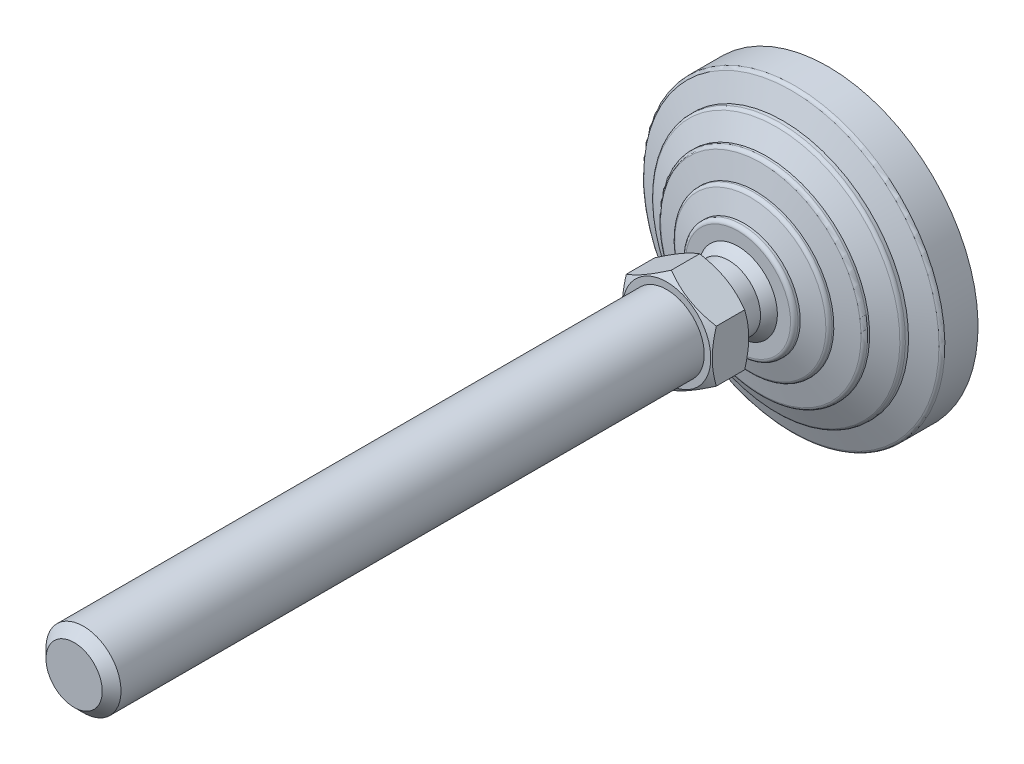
ISO-10303-21;
HEADER;
FILE_DESCRIPTION(('STEP AP214'),'2;1');
FILE_NAME('part.step','',(''),(''),'','','');
FILE_SCHEMA(('AUTOMOTIVE_DESIGN { 1 0 10303 214 1 1 1 1 }'));
ENDSEC;
DATA;
#1=APPLICATION_CONTEXT('core data for automotive mechanical design processes');
#2=APPLICATION_PROTOCOL_DEFINITION('international standard','automotive_design',2000,#1);
#3=PRODUCT_CONTEXT('',#1,'mechanical');
#4=PRODUCT('Part','Part','',(#3));
#5=PRODUCT_RELATED_PRODUCT_CATEGORY('part','',(#4));
#6=PRODUCT_DEFINITION_FORMATION('','',#4);
#7=PRODUCT_DEFINITION_CONTEXT('part definition',#1,'design');
#8=PRODUCT_DEFINITION('design','',#6,#7);
#9=PRODUCT_DEFINITION_SHAPE('','',#8);
#10=(LENGTH_UNIT() NAMED_UNIT(*) SI_UNIT(.MILLI.,.METRE.));
#11=(NAMED_UNIT(*) PLANE_ANGLE_UNIT() SI_UNIT($,.RADIAN.));
#12=(NAMED_UNIT(*) SI_UNIT($,.STERADIAN.) SOLID_ANGLE_UNIT());
#13=UNCERTAINTY_MEASURE_WITH_UNIT(LENGTH_MEASURE(1.E-05),#10,'distance_accuracy_value','');
#14=(GEOMETRIC_REPRESENTATION_CONTEXT(3) GLOBAL_UNCERTAINTY_ASSIGNED_CONTEXT((#13)) GLOBAL_UNIT_ASSIGNED_CONTEXT((#10,
#11,#12)) REPRESENTATION_CONTEXT('',''));
#15=CARTESIAN_POINT('',(0.,0.,0.));
#16=DIRECTION('',(0.,0.,1.));
#17=DIRECTION('',(1.,0.,0.));
#18=AXIS2_PLACEMENT_3D('',#15,#16,#17);
#19=CARTESIAN_POINT('',(-8.5,0.,35.9999999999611));
#20=DIRECTION('',(0.,0.,1.));
#21=DIRECTION('',(0.,-1.,0.));
#22=AXIS2_PLACEMENT_3D('',#19,#20,#21);
#23=PLANE('',#22);
#24=CARTESIAN_POINT('',(0.,0.,36.000000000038));
#25=DIRECTION('',(0.,0.,-1.));
#26=DIRECTION('',(-1.,0.,0.));
#27=AXIS2_PLACEMENT_3D('',#24,#25,#26);
#28=CIRCLE('',#27,11.75);
#29=CARTESIAN_POINT('',(-11.75,0.,36.000000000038));
#30=VERTEX_POINT('',#29);
#31=EDGE_CURVE('E596',#30,#30,#28,.T.);
#32=ORIENTED_EDGE('',*,*,#31,.T.);
#33=EDGE_LOOP('',(#32));
#34=FACE_BOUND('',#33,.T.);
#35=CARTESIAN_POINT('',(0.,0.,35.9999999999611));
#36=DIRECTION('',(0.,0.,-1.));
#37=DIRECTION('',(0.,1.,0.));
#38=AXIS2_PLACEMENT_3D('',#35,#36,#37);
#39=CIRCLE('',#38,8.5);
#40=CARTESIAN_POINT('',(0.,8.5,35.9999999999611));
#41=VERTEX_POINT('',#40);
#42=EDGE_CURVE('E156',#41,#41,#39,.T.);
#43=ORIENTED_EDGE('',*,*,#42,.F.);
#44=EDGE_LOOP('',(#43));
#45=FACE_BOUND('',#44,.T.);
#46=ADVANCED_FACE('F14',(#34,#45),#23,.F.);
#47=CARTESIAN_POINT('',(0.,0.,0.));
#48=DIRECTION('',(0.,0.,-1.));
#49=DIRECTION('',(0.,1.,0.));
#50=AXIS2_PLACEMENT_3D('',#47,#48,#49);
#51=CYLINDRICAL_SURFACE('',#50,8.5);
#52=CARTESIAN_POINT('',(0.,0.,29.4999999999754));
#53=DIRECTION('',(0.,0.,-1.));
#54=DIRECTION('',(0.,1.,0.));
#55=AXIS2_PLACEMENT_3D('',#52,#53,#54);
#56=CIRCLE('',#55,8.5);
#57=CARTESIAN_POINT('',(0.,8.5,29.4999999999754));
#58=VERTEX_POINT('',#57);
#59=EDGE_CURVE('E153',#58,#58,#56,.T.);
#60=ORIENTED_EDGE('',*,*,#59,.F.);
#61=EDGE_LOOP('',(#60));
#62=FACE_BOUND('',#61,.T.);
#63=ORIENTED_EDGE('',*,*,#42,.T.);
#64=EDGE_LOOP('',(#63));
#65=FACE_BOUND('',#64,.T.);
#66=ADVANCED_FACE('F180',(#62,#65),#51,.T.);
#67=CARTESIAN_POINT('',(-8.49107182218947,0.,29.4999999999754));
#68=DIRECTION('',(0.,0.,1.));
#69=DIRECTION('',(0.,-1.,0.));
#70=AXIS2_PLACEMENT_3D('',#67,#68,#69);
#71=PLANE('',#70);
#72=CARTESIAN_POINT('',(0.,0.,29.4999999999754));
#73=DIRECTION('',(0.,0.,-1.));
#74=DIRECTION('',(0.,1.,0.));
#75=AXIS2_PLACEMENT_3D('',#72,#73,#74);
#76=CIRCLE('',#75,8.49107182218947);
#77=CARTESIAN_POINT('',(-8.49107182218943,0.,29.4999999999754));
#78=VERTEX_POINT('',#77);
#79=EDGE_CURVE('E150',#78,#78,#76,.T.);
#80=ORIENTED_EDGE('',*,*,#79,.F.);
#81=EDGE_LOOP('',(#80));
#82=FACE_BOUND('',#81,.T.);
#83=ORIENTED_EDGE('',*,*,#59,.T.);
#84=EDGE_LOOP('',(#83));
#85=FACE_BOUND('',#84,.T.);
#86=ADVANCED_FACE('F187',(#82,#85),#71,.F.);
#87=CARTESIAN_POINT('',(-2.91433543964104E-12,0.,20.6702661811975));
#88=DIRECTION('',(0.,0.,-1.));
#89=DIRECTION('',(-1.,0.,0.));
#90=AXIS2_PLACEMENT_3D('',#87,#88,#89);
#91=SPHERICAL_SURFACE('',#90,12.25);
#92=CARTESIAN_POINT('',(0.,0.,27.));
#93=DIRECTION('',(0.,0.,-1.));
#94=DIRECTION('',(0.,1.,0.));
#95=AXIS2_PLACEMENT_3D('',#92,#93,#94);
#96=CIRCLE('',#95,10.4879440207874);
#97=CARTESIAN_POINT('',(-10.4879440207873,0.,27.));
#98=VERTEX_POINT('',#97);
#99=EDGE_CURVE('E147',#98,#98,#96,.T.);
#100=CARTESIAN_POINT('',(-10.4879440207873,0.,27.));
#101=CARTESIAN_POINT('',(-10.4706730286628,0.,27.0286168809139));
#102=CARTESIAN_POINT('',(-10.4532849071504,0.,27.0571630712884));
#103=CARTESIAN_POINT('',(-10.4182755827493,0.,27.1141121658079));
#104=CARTESIAN_POINT('',(-10.4006543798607,0.,27.1425150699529));
#105=CARTESIAN_POINT('',(-10.3651800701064,0.,27.1991756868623));
#106=CARTESIAN_POINT('',(-10.3473269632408,0.,27.2274333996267));
#107=CARTESIAN_POINT('',(-10.3113900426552,0.,27.283801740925));
#108=CARTESIAN_POINT('',(-10.2933062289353,0.,27.3119123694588));
#109=CARTESIAN_POINT('',(-10.2569091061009,0.,27.367984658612));
#110=CARTESIAN_POINT('',(-10.2385957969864,0.,27.3959463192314));
#111=CARTESIAN_POINT('',(-10.2017409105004,0.,27.4517187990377));
#112=CARTESIAN_POINT('',(-10.1831993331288,0.,27.4795296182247));
#113=CARTESIAN_POINT('',(-10.1458891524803,0.,27.5349985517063));
#114=CARTESIAN_POINT('',(-10.1271205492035,0.,27.5626566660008));
#115=CARTESIAN_POINT('',(-10.0893575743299,0.,27.6178183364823));
#116=CARTESIAN_POINT('',(-10.0703632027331,0.,27.6453218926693));
#117=CARTESIAN_POINT('',(-10.0321499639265,0.,27.7001726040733));
#118=CARTESIAN_POINT('',(-10.0129310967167,0.,27.7275197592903));
#119=CARTESIAN_POINT('',(-9.97427015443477,0.,27.7820558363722));
#120=CARTESIAN_POINT('',(-9.95482807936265,0.,27.8092447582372));
#121=CARTESIAN_POINT('',(-9.91572202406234,0.,27.8634625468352));
#122=CARTESIAN_POINT('',(-9.89605804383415,0.,27.8904914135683));
#123=CARTESIAN_POINT('',(-9.85650949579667,0.,27.9443872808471));
#124=CARTESIAN_POINT('',(-9.83662492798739,0.,27.9712542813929));
#125=CARTESIAN_POINT('',(-9.79663653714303,0.,28.0248246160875));
#126=CARTESIAN_POINT('',(-9.77653271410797,0.,28.0515279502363));
#127=CARTESIAN_POINT('',(-9.73610715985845,0.,28.1047691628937));
#128=CARTESIAN_POINT('',(-9.715785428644,0.,28.1313070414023));
#129=CARTESIAN_POINT('',(-9.67492541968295,0.,28.1842155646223));
#130=CARTESIAN_POINT('',(-9.65438714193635,0.,28.2105862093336));
#131=CARTESIAN_POINT('',(-9.61309541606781,0.,28.2631584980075));
#132=CARTESIAN_POINT('',(-9.59234196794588,0.,28.28936014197));
#133=CARTESIAN_POINT('',(-9.55062129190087,0.,28.3415926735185));
#134=CARTESIAN_POINT('',(-9.5296540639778,0.,28.3676235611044));
#135=CARTESIAN_POINT('',(-9.48750723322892,0.,28.4195128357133));
#136=CARTESIAN_POINT('',(-9.46632763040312,0.,28.4453712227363));
#137=CARTESIAN_POINT('',(-9.42375746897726,0.,28.4969137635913));
#138=CARTESIAN_POINT('',(-9.40236691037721,0.,28.5225979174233));
#139=CARTESIAN_POINT('',(-9.3593762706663,0.,28.5737902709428));
#140=CARTESIAN_POINT('',(-9.33777618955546,0.,28.5992984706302));
#141=CARTESIAN_POINT('',(-9.29436795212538,0.,28.6501372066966));
#142=CARTESIAN_POINT('',(-9.27255979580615,0.,28.6754677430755));
#143=CARTESIAN_POINT('',(-9.22873686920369,0.,28.7259494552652));
#144=CARTESIAN_POINT('',(-9.20672209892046,0.,28.751100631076));
#145=CARTESIAN_POINT('',(-9.16248741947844,0.,28.8012219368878));
#146=CARTESIAN_POINT('',(-9.14026751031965,0.,28.8261920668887));
#147=CARTESIAN_POINT('',(-9.09562404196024,0.,28.87594960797));
#148=CARTESIAN_POINT('',(-9.07320048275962,0.,28.9007370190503));
#149=CARTESIAN_POINT('',(-9.02815121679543,0.,28.9501274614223));
#150=CARTESIAN_POINT('',(-9.00552551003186,0.,28.9747304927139));
#151=CARTESIAN_POINT('',(-8.96007346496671,0.,29.023750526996));
#152=CARTESIAN_POINT('',(-8.93724712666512,0.,29.0481675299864));
#153=CARTESIAN_POINT('',(-8.89139534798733,0.,29.0968138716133));
#154=CARTESIAN_POINT('',(-8.86836990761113,0.,29.1210432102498));
#155=CARTESIAN_POINT('',(-8.82212146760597,0.,29.1693125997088));
#156=CARTESIAN_POINT('',(-8.798898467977,0.,29.1933526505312));
#157=CARTESIAN_POINT('',(-8.75225646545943,0.,29.2412418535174));
#158=CARTESIAN_POINT('',(-8.72883746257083,0.,29.2650910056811));
#159=CARTESIAN_POINT('',(-8.68180502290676,0.,29.3125968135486));
#160=CARTESIAN_POINT('',(-8.6581915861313,0.,29.3362534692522));
#161=CARTESIAN_POINT('',(-8.61077186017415,0.,29.383372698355));
#162=CARTESIAN_POINT('',(-8.58696557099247,0.,29.4068352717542));
#163=CARTESIAN_POINT('',(-8.53916173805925,0.,29.4535647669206));
#164=CARTESIAN_POINT('',(-8.51516419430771,0.,29.4768316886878));
#165=CARTESIAN_POINT('',(-8.49107182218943,0.,29.4999999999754));
#166=B_SPLINE_CURVE_WITH_KNOTS('',3,(#100,#101,#102,#103,#104,#105,#106,#107,#108,#109,#110,
#111,#112,#113,#114,#115,#116,#117,#118,#119,#120,#121,#122,#123,#124,#125,#126,#127,#128,#129,
#130,#131,#132,#133,#134,#135,#136,#137,#138,#139,#140,#141,#142,#143,#144,#145,#146,#147,#148,
#149,#150,#151,#152,#153,#154,#155,#156,#157,#158,#159,#160,#161,#162,#163,#164,#165),
.UNSPECIFIED.,.F.,.F.,(4,2,2,2,2,2,2,2,2,2,2,2,2,2,2,2,2,2,2,2,2,2,2,2,2,2,2,2,2,2,2,2,4),(0.,
0.100273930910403,0.200547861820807,0.30082179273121,0.401095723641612,0.501369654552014,
0.601643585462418,0.701917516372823,0.802191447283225,0.902465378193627,1.00273930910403,
1.10301324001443,1.20328717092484,1.30356110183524,1.40383503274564,1.50410896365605,
1.60438289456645,1.70465682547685,1.80493075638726,1.90520468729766,2.00547861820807,
2.10575254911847,2.20602648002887,2.30630041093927,2.40657434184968,2.50684827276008,
2.60712220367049,2.70739613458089,2.80767006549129,2.90794399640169,3.0082179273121,
3.1084918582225,3.2087657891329),.UNSPECIFIED.);
#167=EDGE_CURVE('BSEAM459',#98,#78,#166,.T.);
#168=ORIENTED_EDGE('',*,*,#99,.F.);
#169=ORIENTED_EDGE('',*,*,#79,.T.);
#170=ORIENTED_EDGE('',*,*,#167,.T.);
#171=ORIENTED_EDGE('',*,*,#167,.F.);
#172=EDGE_LOOP('',(#168,#170,#169,#171));
#173=FACE_BOUND('',#172,.T.);
#174=ADVANCED_FACE('F459',(#173),#91,.T.);
#175=CARTESIAN_POINT('',(-10.4879440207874,0.,27.));
#176=DIRECTION('',(0.,0.,-1.));
#177=DIRECTION('',(0.,1.,0.));
#178=AXIS2_PLACEMENT_3D('',#175,#176,#177);
#179=PLANE('',#178);
#180=CARTESIAN_POINT('',(0.,0.,27.));
#181=DIRECTION('',(0.,0.,-1.));
#182=DIRECTION('',(0.,1.,0.));
#183=AXIS2_PLACEMENT_3D('',#180,#181,#182);
#184=CIRCLE('',#183,14.);
#185=CARTESIAN_POINT('',(0.,14.,27.));
#186=VERTEX_POINT('',#185);
#187=EDGE_CURVE('E144',#186,#186,#184,.T.);
#188=ORIENTED_EDGE('',*,*,#187,.F.);
#189=EDGE_LOOP('',(#188));
#190=FACE_BOUND('',#189,.T.);
#191=ORIENTED_EDGE('',*,*,#99,.T.);
#192=EDGE_LOOP('',(#191));
#193=FACE_BOUND('',#192,.T.);
#194=ADVANCED_FACE('F449',(#190,#193),#179,.F.);
#195=CARTESIAN_POINT('',(0.,0.,26.));
#196=DIRECTION('',(0.,0.,-1.));
#197=DIRECTION('',(0.,1.,0.));
#198=AXIS2_PLACEMENT_3D('',#195,#196,#197);
#199=TOROIDAL_SURFACE('',#198,14.,1.);
#200=CARTESIAN_POINT('',(0.,0.,26.));
#201=DIRECTION('',(0.,0.,-1.));
#202=DIRECTION('',(0.,1.,0.));
#203=AXIS2_PLACEMENT_3D('',#200,#201,#202);
#204=CIRCLE('',#203,15.);
#205=CARTESIAN_POINT('',(0.,15.,26.));
#206=VERTEX_POINT('',#205);
#207=EDGE_CURVE('E141',#206,#206,#204,.T.);
#208=ORIENTED_EDGE('',*,*,#207,.F.);
#209=EDGE_LOOP('',(#208));
#210=FACE_BOUND('',#209,.T.);
#211=ORIENTED_EDGE('',*,*,#187,.T.);
#212=EDGE_LOOP('',(#211));
#213=FACE_BOUND('',#212,.T.);
#214=ADVANCED_FACE('F439',(#210,#213),#199,.T.);
#215=CARTESIAN_POINT('',(0.,0.,0.));
#216=DIRECTION('',(0.,0.,-1.));
#217=DIRECTION('',(0.,1.,0.));
#218=AXIS2_PLACEMENT_3D('',#215,#216,#217);
#219=CYLINDRICAL_SURFACE('',#218,15.);
#220=CARTESIAN_POINT('',(0.,0.,25.4025287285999));
#221=DIRECTION('',(0.,0.,-1.));
#222=DIRECTION('',(0.,1.,0.));
#223=AXIS2_PLACEMENT_3D('',#220,#221,#222);
#224=CIRCLE('',#223,15.);
#225=CARTESIAN_POINT('',(0.,15.,25.4025287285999));
#226=VERTEX_POINT('',#225);
#227=EDGE_CURVE('E138',#226,#226,#224,.T.);
#228=ORIENTED_EDGE('',*,*,#227,.F.);
#229=EDGE_LOOP('',(#228));
#230=FACE_BOUND('',#229,.T.);
#231=ORIENTED_EDGE('',*,*,#207,.T.);
#232=EDGE_LOOP('',(#231));
#233=FACE_BOUND('',#232,.T.);
#234=ADVANCED_FACE('F429',(#230,#233),#219,.T.);
#235=CARTESIAN_POINT('',(0.,0.,25.4025287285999));
#236=DIRECTION('',(0.,0.,-1.));
#237=DIRECTION('',(0.,1.,0.));
#238=AXIS2_PLACEMENT_3D('',#235,#236,#237);
#239=CONICAL_SURFACE('',#238,15.,1.25589726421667);
#240=CARTESIAN_POINT('',(0.,0.,23.7216684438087));
#241=DIRECTION('',(0.,0.,-1.));
#242=DIRECTION('',(0.,1.,0.));
#243=AXIS2_PLACEMENT_3D('',#240,#241,#242);
#244=CIRCLE('',#243,20.16016354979);
#245=CARTESIAN_POINT('',(0.,20.16016354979,23.7216684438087));
#246=VERTEX_POINT('',#245);
#247=EDGE_CURVE('E135',#246,#246,#244,.T.);
#248=ORIENTED_EDGE('',*,*,#247,.F.);
#249=EDGE_LOOP('',(#248));
#250=FACE_BOUND('',#249,.T.);
#251=ORIENTED_EDGE('',*,*,#227,.T.);
#252=EDGE_LOOP('',(#251));
#253=FACE_BOUND('',#252,.T.);
#254=ADVANCED_FACE('F419',(#250,#253),#239,.T.);
#255=CARTESIAN_POINT('',(0.,0.,22.7708407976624));
#256=DIRECTION('',(0.,0.,-1.));
#257=DIRECTION('',(0.,1.,0.));
#258=AXIS2_PLACEMENT_3D('',#255,#256,#257);
#259=TOROIDAL_SURFACE('',#258,19.8504430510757,1.);
#260=CARTESIAN_POINT('',(0.,0.,22.7708407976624));
#261=DIRECTION('',(0.,0.,-1.));
#262=DIRECTION('',(0.,1.,0.));
#263=AXIS2_PLACEMENT_3D('',#260,#261,#262);
#264=CIRCLE('',#263,20.8504430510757);
#265=CARTESIAN_POINT('',(0.,20.8504430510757,22.7708407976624));
#266=VERTEX_POINT('',#265);
#267=EDGE_CURVE('E132',#266,#266,#264,.T.);
#268=ORIENTED_EDGE('',*,*,#267,.F.);
#269=EDGE_LOOP('',(#268));
#270=FACE_BOUND('',#269,.T.);
#271=ORIENTED_EDGE('',*,*,#247,.T.);
#272=EDGE_LOOP('',(#271));
#273=FACE_BOUND('',#272,.T.);
#274=ADVANCED_FACE('F409',(#270,#273),#259,.T.);
#275=CARTESIAN_POINT('',(0.,0.,0.));
#276=DIRECTION('',(0.,0.,-1.));
#277=DIRECTION('',(0.,1.,0.));
#278=AXIS2_PLACEMENT_3D('',#275,#276,#277);
#279=CYLINDRICAL_SURFACE('',#278,20.8504430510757);
#280=CARTESIAN_POINT('',(0.,0.,22.2987385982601));
#281=DIRECTION('',(0.,0.,-1.));
#282=DIRECTION('',(0.,1.,0.));
#283=AXIS2_PLACEMENT_3D('',#280,#281,#282);
#284=CIRCLE('',#283,20.8504430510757);
#285=CARTESIAN_POINT('',(0.,20.8504430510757,22.2987385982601));
#286=VERTEX_POINT('',#285);
#287=EDGE_CURVE('E129',#286,#286,#284,.T.);
#288=ORIENTED_EDGE('',*,*,#287,.F.);
#289=EDGE_LOOP('',(#288));
#290=FACE_BOUND('',#289,.T.);
#291=ORIENTED_EDGE('',*,*,#267,.T.);
#292=EDGE_LOOP('',(#291));
#293=FACE_BOUND('',#292,.T.);
#294=ADVANCED_FACE('F399',(#290,#293),#279,.T.);
#295=CARTESIAN_POINT('',(0.,0.,22.2987385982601));
#296=DIRECTION('',(0.,0.,-1.));
#297=DIRECTION('',(0.,1.,0.));
#298=AXIS2_PLACEMENT_3D('',#295,#296,#297);
#299=CONICAL_SURFACE('',#298,20.8504430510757,1.34067144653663);
#300=CARTESIAN_POINT('',(0.,0.,20.9217501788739));
#301=DIRECTION('',(0.,0.,-1.));
#302=DIRECTION('',(0.,1.,0.));
#303=AXIS2_PLACEMENT_3D('',#300,#301,#302);
#304=CIRCLE('',#303,26.728099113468);
#305=CARTESIAN_POINT('',(0.,26.728099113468,20.9217501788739));
#306=VERTEX_POINT('',#305);
#307=EDGE_CURVE('E126',#306,#306,#304,.T.);
#308=ORIENTED_EDGE('',*,*,#307,.F.);
#309=EDGE_LOOP('',(#308));
#310=FACE_BOUND('',#309,.T.);
#311=ORIENTED_EDGE('',*,*,#287,.T.);
#312=EDGE_LOOP('',(#311));
#313=FACE_BOUND('',#312,.T.);
#314=ADVANCED_FACE('F389',(#310,#313),#299,.T.);
#315=CARTESIAN_POINT('',(0.,0.,19.9481122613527));
#316=DIRECTION('',(0.,0.,-1.));
#317=DIRECTION('',(0.,1.,0.));
#318=AXIS2_PLACEMENT_3D('',#315,#316,#317);
#319=TOROIDAL_SURFACE('',#318,26.5,1.00000000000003);
#320=CARTESIAN_POINT('',(0.,0.,19.9481122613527));
#321=DIRECTION('',(0.,0.,-1.));
#322=DIRECTION('',(0.,1.,0.));
#323=AXIS2_PLACEMENT_3D('',#320,#321,#322);
#324=CIRCLE('',#323,27.5);
#325=CARTESIAN_POINT('',(0.,27.5,19.9481122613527));
#326=VERTEX_POINT('',#325);
#327=EDGE_CURVE('E123',#326,#326,#324,.T.);
#328=ORIENTED_EDGE('',*,*,#327,.F.);
#329=EDGE_LOOP('',(#328));
#330=FACE_BOUND('',#329,.T.);
#331=ORIENTED_EDGE('',*,*,#307,.T.);
#332=EDGE_LOOP('',(#331));
#333=FACE_BOUND('',#332,.T.);
#334=ADVANCED_FACE('F379',(#330,#333),#319,.T.);
#335=CARTESIAN_POINT('',(0.,0.,0.));
#336=DIRECTION('',(0.,0.,-1.));
#337=DIRECTION('',(0.,1.,0.));
#338=AXIS2_PLACEMENT_3D('',#335,#336,#337);
#339=CYLINDRICAL_SURFACE('',#338,27.5);
#340=CARTESIAN_POINT('',(0.,0.,19.4025287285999));
#341=DIRECTION('',(0.,0.,-1.));
#342=DIRECTION('',(0.,1.,0.));
#343=AXIS2_PLACEMENT_3D('',#340,#341,#342);
#344=CIRCLE('',#343,27.5);
#345=CARTESIAN_POINT('',(0.,27.5,19.4025287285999));
#346=VERTEX_POINT('',#345);
#347=EDGE_CURVE('E120',#346,#346,#344,.T.);
#348=ORIENTED_EDGE('',*,*,#347,.F.);
#349=EDGE_LOOP('',(#348));
#350=FACE_BOUND('',#349,.T.);
#351=ORIENTED_EDGE('',*,*,#327,.T.);
#352=EDGE_LOOP('',(#351));
#353=FACE_BOUND('',#352,.T.);
#354=ADVANCED_FACE('F369',(#350,#353),#339,.T.);
#355=CARTESIAN_POINT('',(0.,0.,19.4025287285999));
#356=DIRECTION('',(0.,0.,-1.));
#357=DIRECTION('',(0.,1.,0.));
#358=AXIS2_PLACEMENT_3D('',#355,#356,#357);
#359=CONICAL_SURFACE('',#358,27.5,1.1202291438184);
#360=CARTESIAN_POINT('',(0.,0.,16.7730910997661));
#361=DIRECTION('',(0.,0.,-1.));
#362=DIRECTION('',(0.,1.,0.));
#363=AXIS2_PLACEMENT_3D('',#360,#361,#362);
#364=CIRCLE('',#363,32.9354761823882);
#365=CARTESIAN_POINT('',(0.,32.9354761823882,16.7730910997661));
#366=VERTEX_POINT('',#365);
#367=EDGE_CURVE('E117',#366,#366,#364,.T.);
#368=ORIENTED_EDGE('',*,*,#367,.F.);
#369=EDGE_LOOP('',(#368));
#370=FACE_BOUND('',#369,.T.);
#371=ORIENTED_EDGE('',*,*,#347,.T.);
#372=EDGE_LOOP('',(#371));
#373=FACE_BOUND('',#372,.T.);
#374=ADVANCED_FACE('F359',(#370,#373),#359,.T.);
#375=CARTESIAN_POINT('',(0.,0.,15.8728908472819));
#376=DIRECTION('',(0.,0.,-1.));
#377=DIRECTION('',(0.,1.,0.));
#378=AXIS2_PLACEMENT_3D('',#375,#376,#377);
#379=TOROIDAL_SURFACE('',#378,32.5,0.999999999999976);
#380=CARTESIAN_POINT('',(0.,0.,15.8728908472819));
#381=DIRECTION('',(0.,0.,-1.));
#382=DIRECTION('',(0.,1.,0.));
#383=AXIS2_PLACEMENT_3D('',#380,#381,#382);
#384=CIRCLE('',#383,33.5);
#385=CARTESIAN_POINT('',(0.,33.5,15.8728908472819));
#386=VERTEX_POINT('',#385);
#387=EDGE_CURVE('E114',#386,#386,#384,.T.);
#388=ORIENTED_EDGE('',*,*,#387,.F.);
#389=EDGE_LOOP('',(#388));
#390=FACE_BOUND('',#389,.T.);
#391=ORIENTED_EDGE('',*,*,#367,.T.);
#392=EDGE_LOOP('',(#391));
#393=FACE_BOUND('',#392,.T.);
#394=ADVANCED_FACE('F349',(#390,#393),#379,.T.);
#395=CARTESIAN_POINT('',(0.,0.,0.));
#396=DIRECTION('',(0.,0.,-1.));
#397=DIRECTION('',(0.,1.,0.));
#398=AXIS2_PLACEMENT_3D('',#395,#396,#397);
#399=CYLINDRICAL_SURFACE('',#398,33.5);
#400=CARTESIAN_POINT('',(0.,0.,15.0315037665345));
#401=DIRECTION('',(0.,0.,-1.));
#402=DIRECTION('',(0.,1.,0.));
#403=AXIS2_PLACEMENT_3D('',#400,#401,#402);
#404=CIRCLE('',#403,33.5);
#405=CARTESIAN_POINT('',(0.,33.5,15.0315037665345));
#406=VERTEX_POINT('',#405);
#407=EDGE_CURVE('E111',#406,#406,#404,.T.);
#408=ORIENTED_EDGE('',*,*,#407,.F.);
#409=EDGE_LOOP('',(#408));
#410=FACE_BOUND('',#409,.T.);
#411=ORIENTED_EDGE('',*,*,#387,.T.);
#412=EDGE_LOOP('',(#411));
#413=FACE_BOUND('',#412,.T.);
#414=ADVANCED_FACE('F339',(#410,#413),#399,.T.);
#415=CARTESIAN_POINT('',(0.,0.,15.0315037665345));
#416=DIRECTION('',(0.,0.,-1.));
#417=DIRECTION('',(0.,1.,0.));
#418=AXIS2_PLACEMENT_3D('',#415,#416,#417);
#419=CONICAL_SURFACE('',#418,33.5,1.20362249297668);
#420=CARTESIAN_POINT('',(0.,0.,12.7780502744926));
#421=DIRECTION('',(0.,0.,-1.));
#422=DIRECTION('',(0.,1.,0.));
#423=AXIS2_PLACEMENT_3D('',#420,#421,#422);
#424=CIRCLE('',#423,39.3589790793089);
#425=CARTESIAN_POINT('',(0.,39.3589790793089,12.7780502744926));
#426=VERTEX_POINT('',#425);
#427=EDGE_CURVE('E108',#426,#426,#424,.T.);
#428=ORIENTED_EDGE('',*,*,#427,.F.);
#429=EDGE_LOOP('',(#428));
#430=FACE_BOUND('',#429,.T.);
#431=ORIENTED_EDGE('',*,*,#407,.T.);
#432=EDGE_LOOP('',(#431));
#433=FACE_BOUND('',#432,.T.);
#434=ADVANCED_FACE('F329',(#430,#433),#419,.T.);
#435=CARTESIAN_POINT('',(0.,0.,11.8447046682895));
#436=DIRECTION('',(0.,0.,-1.));
#437=DIRECTION('',(0.,1.,0.));
#438=AXIS2_PLACEMENT_3D('',#435,#436,#437);
#439=TOROIDAL_SURFACE('',#438,39.,1.00000000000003);
#440=CARTESIAN_POINT('',(0.,0.,11.8447046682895));
#441=DIRECTION('',(0.,0.,-1.));
#442=DIRECTION('',(0.,1.,0.));
#443=AXIS2_PLACEMENT_3D('',#440,#441,#442);
#444=CIRCLE('',#443,40.);
#445=CARTESIAN_POINT('',(0.,40.,11.8447046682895));
#446=VERTEX_POINT('',#445);
#447=EDGE_CURVE('E105',#446,#446,#444,.T.);
#448=ORIENTED_EDGE('',*,*,#447,.F.);
#449=EDGE_LOOP('',(#448));
#450=FACE_BOUND('',#449,.T.);
#451=ORIENTED_EDGE('',*,*,#427,.T.);
#452=EDGE_LOOP('',(#451));
#453=FACE_BOUND('',#452,.T.);
#454=ADVANCED_FACE('F319',(#450,#453),#439,.T.);
#455=CARTESIAN_POINT('',(0.,0.,0.));
#456=DIRECTION('',(0.,0.,-1.));
#457=DIRECTION('',(0.,1.,0.));
#458=AXIS2_PLACEMENT_3D('',#455,#456,#457);
#459=CYLINDRICAL_SURFACE('',#458,40.);
#460=CARTESIAN_POINT('',(0.,0.,3.));
#461=DIRECTION('',(0.,0.,-1.));
#462=DIRECTION('',(0.,1.,0.));
#463=AXIS2_PLACEMENT_3D('',#460,#461,#462);
#464=CIRCLE('',#463,40.);
#465=CARTESIAN_POINT('',(0.,40.,3.));
#466=VERTEX_POINT('',#465);
#467=EDGE_CURVE('E102',#466,#466,#464,.T.);
#468=ORIENTED_EDGE('',*,*,#467,.F.);
#469=EDGE_LOOP('',(#468));
#470=FACE_BOUND('',#469,.T.);
#471=ORIENTED_EDGE('',*,*,#447,.T.);
#472=EDGE_LOOP('',(#471));
#473=FACE_BOUND('',#472,.T.);
#474=ADVANCED_FACE('F309',(#470,#473),#459,.T.);
#475=CARTESIAN_POINT('',(-33.5,0.,3.));
#476=DIRECTION('',(0.,0.,1.));
#477=DIRECTION('',(0.,-1.,0.));
#478=AXIS2_PLACEMENT_3D('',#475,#476,#477);
#479=PLANE('',#478);
#480=CARTESIAN_POINT('',(0.,0.,3.));
#481=DIRECTION('',(0.,0.,-1.));
#482=DIRECTION('',(0.,1.,0.));
#483=AXIS2_PLACEMENT_3D('',#480,#481,#482);
#484=CIRCLE('',#483,33.5);
#485=CARTESIAN_POINT('',(0.,33.5,3.));
#486=VERTEX_POINT('',#485);
#487=EDGE_CURVE('E99',#486,#486,#484,.T.);
#488=ORIENTED_EDGE('',*,*,#487,.F.);
#489=EDGE_LOOP('',(#488));
#490=FACE_BOUND('',#489,.T.);
#491=ORIENTED_EDGE('',*,*,#467,.T.);
#492=EDGE_LOOP('',(#491));
#493=FACE_BOUND('',#492,.T.);
#494=ADVANCED_FACE('F299',(#490,#493),#479,.F.);
#495=CARTESIAN_POINT('',(0.,0.,0.));
#496=DIRECTION('',(0.,0.,-1.));
#497=DIRECTION('',(0.,1.,0.));
#498=AXIS2_PLACEMENT_3D('',#495,#496,#497);
#499=CYLINDRICAL_SURFACE('',#498,33.5);
#500=CARTESIAN_POINT('',(0.,0.,0.));
#501=DIRECTION('',(0.,0.,-1.));
#502=DIRECTION('',(0.,1.,0.));
#503=AXIS2_PLACEMENT_3D('',#500,#501,#502);
#504=CIRCLE('',#503,33.5);
#505=CARTESIAN_POINT('',(0.,33.5,0.));
#506=VERTEX_POINT('',#505);
#507=EDGE_CURVE('E96',#506,#506,#504,.T.);
#508=ORIENTED_EDGE('',*,*,#507,.F.);
#509=EDGE_LOOP('',(#508));
#510=FACE_BOUND('',#509,.T.);
#511=ORIENTED_EDGE('',*,*,#487,.T.);
#512=EDGE_LOOP('',(#511));
#513=FACE_BOUND('',#512,.T.);
#514=ADVANCED_FACE('F288',(#510,#513),#499,.T.);
#515=CARTESIAN_POINT('',(0.,0.,0.));
#516=DIRECTION('',(0.,0.,1.));
#517=DIRECTION('',(0.,-1.,0.));
#518=AXIS2_PLACEMENT_3D('',#515,#516,#517);
#519=PLANE('',#518);
#520=ORIENTED_EDGE('',*,*,#507,.T.);
#521=EDGE_LOOP('',(#520));
#522=FACE_BOUND('',#521,.T.);
#523=ADVANCED_FACE('F178',(#522),#519,.F.);
#524=CARTESIAN_POINT('',(0.,0.,38.685393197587));
#525=DIRECTION('',(0.,0.,1.));
#526=DIRECTION('',(1.,0.,0.));
#527=AXIS2_PLACEMENT_3D('',#524,#525,#526);
#528=CONICAL_SURFACE('',#527,16.4012374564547,1.0471975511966);
#529=CARTESIAN_POINT('',(0.436480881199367,-14.1084088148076,37.3655252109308));
#530=CARTESIAN_POINT('',(0.15637880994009,-13.9466918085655,37.2672254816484));
#531=CARTESIAN_POINT('',(-0.124816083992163,-13.784343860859,37.1731368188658));
#532=CARTESIAN_POINT('',(-0.689651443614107,-13.4582360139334,36.9946703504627));
#533=CARTESIAN_POINT('',(-0.973293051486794,-13.2944754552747,36.9102973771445));
#534=CARTESIAN_POINT('',(-1.82945282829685,-12.8001713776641,36.6733871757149));
#535=CARTESIAN_POINT('',(-2.40564063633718,-12.4675091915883,36.5376236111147));
#536=CARTESIAN_POINT('',(-3.26733445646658,-11.9700100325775,36.3775776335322));
#537=CARTESIAN_POINT('',(-3.54992570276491,-11.8068559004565,36.3318712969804));
#538=CARTESIAN_POINT('',(-4.116598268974,-11.4796873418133,36.2547687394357));
#539=CARTESIAN_POINT('',(-4.40067960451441,-11.3156729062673,36.2233726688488));
#540=CARTESIAN_POINT('',(-4.96933945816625,-10.9873569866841,36.1757901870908));
#541=CARTESIAN_POINT('',(-5.25391643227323,-10.8230563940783,36.1595792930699));
#542=CARTESIAN_POINT('',(-5.82341873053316,-10.4942540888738,36.1427420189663));
#543=CARTESIAN_POINT('',(-6.10834405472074,-10.3297523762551,36.1421156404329));
#544=CARTESIAN_POINT('',(-6.69582556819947,-9.99056976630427,36.1569217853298));
#545=CARTESIAN_POINT('',(-6.99836277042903,-9.81589983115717,36.1733675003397));
#546=CARTESIAN_POINT('',(-7.60237303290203,-9.46717434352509,36.2233612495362));
#547=CARTESIAN_POINT('',(-7.90384605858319,-9.29311881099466,36.2569098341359));
#548=CARTESIAN_POINT('',(-8.5056878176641,-8.94564530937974,36.3401663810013));
#549=CARTESIAN_POINT('',(-8.80605330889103,-8.7722292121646,36.3899053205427));
#550=CARTESIAN_POINT('',(-9.40464744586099,-8.42663072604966,36.5041567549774));
#551=CARTESIAN_POINT('',(-9.70287611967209,-8.25444832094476,36.5686690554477));
#552=CARTESIAN_POINT('',(-10.306441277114,-7.90597981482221,36.7132024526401));
#553=CARTESIAN_POINT('',(-10.6117000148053,-7.72973860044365,36.7936535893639));
#554=CARTESIAN_POINT('',(-11.2195880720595,-7.37877426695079,36.9669363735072));
#555=CARTESIAN_POINT('',(-11.5222171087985,-7.2040513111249,37.0597693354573));
#556=CARTESIAN_POINT('',(-12.1235876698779,-6.85684985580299,37.2557507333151));
#557=CARTESIAN_POINT('',(-12.4223401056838,-6.68436505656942,37.35885483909));
#558=CARTESIAN_POINT('',(-13.0172413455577,-6.34089866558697,37.5742198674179));
#559=CARTESIAN_POINT('',(-13.3133910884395,-6.16991653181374,37.6864773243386));
#560=CARTESIAN_POINT('',(-13.6083588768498,-5.99961679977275,37.8026127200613));
#561=B_SPLINE_CURVE_WITH_KNOTS('',3,(#529,#530,#531,#532,#533,#534,#535,#536,#537,#538,#539,
#540,#541,#542,#543,#544,#545,#546,#547,#548,#549,#550,#551,#552,#553,#554,#555,#556,#557,#558,
#559,#560),.UNSPECIFIED.,.F.,.F.,(4,2,2,2,2,2,2,2,2,2,2,2,2,2,2,4),(0.,1.01404152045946,
2.02858523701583,4.06334453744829,5.0515722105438,6.03981027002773,7.02645225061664,
8.0130943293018,9.06183339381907,10.1106062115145,11.1613975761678,12.2121751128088,
13.2965608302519,14.3810617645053,15.461069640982,16.5406704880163),.UNSPECIFIED.);
#562=CARTESIAN_POINT('',(0.,-13.856406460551,37.2161343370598));
#563=VERTEX_POINT('',#562);
#564=CARTESIAN_POINT('',(-12.,-6.92820323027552,37.2161343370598));
#565=VERTEX_POINT('',#564);
#566=EDGE_CURVE('E73',#563,#565,#561,.T.);
#567=ORIENTED_EDGE('',*,*,#566,.T.);
#568=CARTESIAN_POINT('',(-12.,-18.5590226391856,41.9759321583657));
#569=CARTESIAN_POINT('',(-12.,-18.297186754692,41.8489886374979));
#570=CARTESIAN_POINT('',(-12.,-18.0350422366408,41.7226820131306));
#571=CARTESIAN_POINT('',(-12.,-17.5100715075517,41.4714869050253));
#572=CARTESIAN_POINT('',(-12.,-17.2472452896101,41.3465984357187));
#573=CARTESIAN_POINT('',(-12.,-16.4575767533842,40.9742435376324));
#574=CARTESIAN_POINT('',(-12.,-15.9296227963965,40.7291256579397));
#575=CARTESIAN_POINT('',(-12.,-14.8672670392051,40.2453140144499));
#576=CARTESIAN_POINT('',(-12.,-14.3328457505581,40.0066629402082));
#577=CARTESIAN_POINT('',(-12.,-13.2597352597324,39.5391916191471));
#578=CARTESIAN_POINT('',(-12.,-12.721046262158,39.3103709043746));
#579=CARTESIAN_POINT('',(-12.,-11.6213473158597,38.85809102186));
#580=CARTESIAN_POINT('',(-12.,-11.0601716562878,38.6350326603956));
#581=CARTESIAN_POINT('',(-12.,-9.93123212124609,38.2059208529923));
#582=CARTESIAN_POINT('',(-12.,-9.36346751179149,37.9998693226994));
#583=CARTESIAN_POINT('',(-12.,-8.22154478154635,37.610220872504));
#584=CARTESIAN_POINT('',(-12.,-7.64740245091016,37.4265780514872));
#585=CARTESIAN_POINT('',(-12.,-6.4908276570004,37.0876634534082));
#586=CARTESIAN_POINT('',(-12.,-5.90839788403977,36.9323826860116));
#587=CARTESIAN_POINT('',(-12.,-5.03004946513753,36.7268010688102));
#588=CARTESIAN_POINT('',(-12.,-4.73727893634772,36.662966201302));
#589=CARTESIAN_POINT('',(-12.,-4.14974701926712,36.5451750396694));
#590=CARTESIAN_POINT('',(-12.,-3.85498567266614,36.4912185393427));
#591=CARTESIAN_POINT('',(-12.,-3.26367872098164,36.3941395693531));
#592=CARTESIAN_POINT('',(-12.,-2.96713313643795,36.3510169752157));
#593=CARTESIAN_POINT('',(-12.,-2.37257657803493,36.2764680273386));
#594=CARTESIAN_POINT('',(-12.,-2.07456566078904,36.2450412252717));
#595=CARTESIAN_POINT('',(-12.,-1.48136326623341,36.1948993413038));
#596=CARTESIAN_POINT('',(-12.,-1.18618536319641,36.1760246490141));
#597=CARTESIAN_POINT('',(-12.,-0.595296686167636,36.1507714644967));
#598=CARTESIAN_POINT('',(-12.,-0.299585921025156,36.1443927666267));
#599=CARTESIAN_POINT('',(-12.,0.291841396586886,36.1442830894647));
#600=CARTESIAN_POINT('',(-12.,0.58755794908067,36.1505521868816));
#601=CARTESIAN_POINT('',(-12.,1.17846521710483,36.1755860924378));
#602=CARTESIAN_POINT('',(-12.,1.47365590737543,36.1943514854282));
#603=CARTESIAN_POINT('',(-12.,2.18464512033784,36.2542028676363));
#604=CARTESIAN_POINT('',(-12.,2.59994605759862,36.3013041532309));
#605=CARTESIAN_POINT('',(-12.,3.42743443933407,36.4176636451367));
#606=CARTESIAN_POINT('',(-12.,3.83962144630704,36.4869249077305));
#607=CARTESIAN_POINT('',(-12.,4.66049986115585,36.6451403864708));
#608=CARTESIAN_POINT('',(-12.,5.06918824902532,36.7341101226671));
#609=CARTESIAN_POINT('',(-12.,5.88245007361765,36.9290305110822));
#610=CARTESIAN_POINT('',(-12.,6.28702357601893,37.0349808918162));
#611=CARTESIAN_POINT('',(-12.,7.10091521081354,37.2637812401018));
#612=CARTESIAN_POINT('',(-12.,7.51014287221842,37.3869508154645));
#613=CARTESIAN_POINT('',(-12.,8.32456629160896,37.6459003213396));
#614=CARTESIAN_POINT('',(-12.,8.72976202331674,37.7816803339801));
#615=CARTESIAN_POINT('',(-12.,9.53632380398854,38.063704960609));
#616=CARTESIAN_POINT('',(-12.,9.93769110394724,38.2099460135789));
#617=CARTESIAN_POINT('',(-12.,10.7371076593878,38.5111836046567));
#618=CARTESIAN_POINT('',(-12.,11.1351569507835,38.6661800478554));
#619=CARTESIAN_POINT('',(-12.,12.0623305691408,39.0370857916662));
#620=CARTESIAN_POINT('',(-12.,12.5902985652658,39.2558810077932));
#621=CARTESIAN_POINT('',(-12.,13.6418431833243,39.7038104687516));
#622=CARTESIAN_POINT('',(-12.,14.1654195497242,39.9329453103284));
#623=CARTESIAN_POINT('',(-12.,15.2089825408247,40.3995174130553));
#624=CARTESIAN_POINT('',(-12.,15.7289683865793,40.6369564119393));
#625=CARTESIAN_POINT('',(-12.,16.7658291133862,41.1184900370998));
#626=CARTESIAN_POINT('',(-12.,17.2827040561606,41.3625845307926));
#627=CARTESIAN_POINT('',(-12.,18.3143902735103,41.8564623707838));
#628=CARTESIAN_POINT('',(-12.,18.8291988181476,42.106251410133));
#629=CARTESIAN_POINT('',(-12.,19.8566166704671,42.6103111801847));
#630=CARTESIAN_POINT('',(-12.,20.3692259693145,42.8645819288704));
#631=CARTESIAN_POINT('',(-12.,21.3925161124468,43.3768165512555));
#632=CARTESIAN_POINT('',(-12.,21.9031971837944,43.6347799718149));
#633=CARTESIAN_POINT('',(-12.,22.9229682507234,44.1538344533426));
#634=CARTESIAN_POINT('',(-12.,23.432058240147,44.414925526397));
#635=CARTESIAN_POINT('',(-12.,24.8739902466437,45.1591558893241));
#636=CARTESIAN_POINT('',(-12.,25.8052204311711,45.6454180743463));
#637=CARTESIAN_POINT('',(-12.,27.6642060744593,46.624598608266));
#638=CARTESIAN_POINT('',(-12.,28.591961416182,47.1175171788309));
#639=CARTESIAN_POINT('',(-12.,30.442516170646,48.1072758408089));
#640=CARTESIAN_POINT('',(-12.,31.365322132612,48.6041036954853));
#641=CARTESIAN_POINT('',(-12.,32.7478858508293,49.3523238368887));
#642=CARTESIAN_POINT('',(-12.,33.2084542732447,49.6022204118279));
#643=CARTESIAN_POINT('',(-12.,34.129104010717,50.1029076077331));
#644=CARTESIAN_POINT('',(-12.,34.5891853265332,50.3536982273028));
#645=CARTESIAN_POINT('',(-12.,35.0490504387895,50.6048847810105));
#646=B_SPLINE_CURVE_WITH_KNOTS('',3,(#568,#569,#570,#571,#572,#573,#574,#575,#576,#577,#578,
#579,#580,#581,#582,#583,#584,#585,#586,#587,#588,#589,#590,#591,#592,#593,#594,#595,#596,#597,
#598,#599,#600,#601,#602,#603,#604,#605,#606,#607,#608,#609,#610,#611,#612,#613,#614,#615,#616,
#617,#618,#619,#620,#621,#622,#623,#624,#625,#626,#627,#628,#629,#630,#631,#632,#633,#634,#635,
#636,#637,#638,#639,#640,#641,#642,#643,#644,#645),.UNSPECIFIED.,.F.,.F.,(4,2,2,2,2,2,2,2,2,2,2,
2,2,2,2,2,2,2,2,2,2,2,2,2,2,2,2,2,2,2,2,2,2,2,2,2,2,2,4),(0.,0.872955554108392,1.74591998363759,
3.49210982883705,5.24789263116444,7.0035917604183,8.81502653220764,10.6266650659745,
12.4345280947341,14.2418170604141,15.1406240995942,16.0394123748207,16.9381903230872,
17.8369338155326,18.7240186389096,19.6110888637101,20.4981644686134,21.3852815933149,
22.6384771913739,23.8918457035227,25.1462047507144,26.4005437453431,27.6823856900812,
28.9642359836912,30.2456519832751,31.5270540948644,33.2414303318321,34.9559056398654,
36.6707418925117,38.3855440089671,40.1021429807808,41.8187488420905,43.535145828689,
45.2515494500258,48.4031377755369,51.5548313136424,54.6989678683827,56.270954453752,
57.8429385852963),.UNSPECIFIED.);
#647=CARTESIAN_POINT('',(-12.,6.92820323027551,37.2161343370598));
#648=VERTEX_POINT('',#647);
#649=EDGE_CURVE('E81',#565,#648,#646,.T.);
#650=ORIENTED_EDGE('',*,*,#649,.T.);
#651=CARTESIAN_POINT('',(-21.7827970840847,1.28010270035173,41.8141356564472));
#652=CARTESIAN_POINT('',(-21.5523257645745,1.41316537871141,41.6858119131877));
#653=CARTESIAN_POINT('',(-21.3215686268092,1.54639307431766,41.5581729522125));
#654=CARTESIAN_POINT('',(-20.8594213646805,1.8132139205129,41.3044243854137));
#655=CARTESIAN_POINT('',(-20.6280312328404,1.94680707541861,41.178314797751));
#656=CARTESIAN_POINT('',(-19.9327454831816,2.34823049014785,40.8024799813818));
#657=CARTESIAN_POINT('',(-19.4678160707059,2.61665761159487,40.5552942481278));
#658=CARTESIAN_POINT('',(-18.5317259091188,3.15710951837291,40.0678251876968));
#659=CARTESIAN_POINT('',(-18.0605443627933,3.42914631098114,39.8275949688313));
#660=CARTESIAN_POINT('',(-17.1141841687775,3.97552762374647,39.3579121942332));
#661=CARTESIAN_POINT('',(-16.6390057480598,4.24987201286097,39.128459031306));
#662=CARTESIAN_POINT('',(-15.6792910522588,4.80396355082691,38.6811523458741));
#663=CARTESIAN_POINT('',(-15.194708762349,5.08373726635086,38.463429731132));
#664=CARTESIAN_POINT('',(-14.2196561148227,5.64668417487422,38.0459589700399));
#665=CARTESIAN_POINT('',(-13.7291850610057,5.9298577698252,37.8462129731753));
#666=CARTESIAN_POINT('',(-12.74271983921,6.49939373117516,37.4704473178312));
#667=CARTESIAN_POINT('',(-12.246741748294,6.78574681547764,37.2943718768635));
#668=CARTESIAN_POINT('',(-11.247595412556,7.36260422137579,36.972034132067));
#669=CARTESIAN_POINT('',(-10.7444297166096,7.65310707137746,36.8257615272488));
#670=CARTESIAN_POINT('',(-9.98830281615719,8.08965714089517,36.6354251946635));
#671=CARTESIAN_POINT('',(-9.73799984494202,8.23416962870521,36.5771716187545));
#672=CARTESIAN_POINT('',(-9.23579400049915,8.5241183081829,36.4706717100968));
#673=CARTESIAN_POINT('',(-8.98389116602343,8.6695544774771,36.4224251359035));
#674=CARTESIAN_POINT('',(-8.47867151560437,8.96124317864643,36.3368125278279));
#675=CARTESIAN_POINT('',(-8.22535456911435,9.10749578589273,36.2994475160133));
#676=CARTESIAN_POINT('',(-7.71763631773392,9.40062705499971,36.2363617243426));
#677=CARTESIAN_POINT('',(-7.46323504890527,9.54750569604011,36.2106405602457));
#678=CARTESIAN_POINT('',(-6.9551707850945,9.84083673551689,36.1715175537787));
#679=CARTESIAN_POINT('',(-6.70151181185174,9.98728681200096,36.1580465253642));
#680=CARTESIAN_POINT('',(-6.19392944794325,10.2803396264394,36.1434817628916));
#681=CARTESIAN_POINT('',(-5.94000606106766,10.4269423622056,36.1423878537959));
#682=CARTESIAN_POINT('',(-5.4324102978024,10.7200029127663,36.1526023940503));
#683=CARTESIAN_POINT('',(-5.1787378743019,10.8664607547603,36.1639077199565));
#684=CARTESIAN_POINT('',(-4.6720133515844,11.1590182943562,36.198652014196));
#685=CARTESIAN_POINT('',(-4.41896128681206,11.3051179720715,36.2220916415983));
#686=CARTESIAN_POINT('',(-3.79553414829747,11.6650537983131,36.294313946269));
#687=CARTESIAN_POINT('',(-3.42573479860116,11.8785575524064,36.3498249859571));
#688=CARTESIAN_POINT('',(-2.68922794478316,12.3037799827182,36.4835804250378));
#689=CARTESIAN_POINT('',(-2.32252095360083,12.515498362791,36.5618285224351));
#690=CARTESIAN_POINT('',(-1.5919436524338,12.9372973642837,36.7383904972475));
#691=CARTESIAN_POINT('',(-1.2280813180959,13.1473733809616,36.8367479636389));
#692=CARTESIAN_POINT('',(-0.504179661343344,13.5653181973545,37.0504942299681));
#693=CARTESIAN_POINT('',(-0.144140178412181,13.7731870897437,37.165882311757));
#694=CARTESIAN_POINT('',(0.580217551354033,14.1913952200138,37.413707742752));
#695=CARTESIAN_POINT('',(0.944452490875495,14.4016863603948,37.5464675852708));
#696=CARTESIAN_POINT('',(1.66935697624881,14.8202101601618,37.8244279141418));
#697=CARTESIAN_POINT('',(2.0300262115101,15.0284426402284,37.9696294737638));
#698=CARTESIAN_POINT('',(2.74605329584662,15.4418410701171,38.269464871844));
#699=CARTESIAN_POINT('',(3.10142976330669,15.6470177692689,38.4240396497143));
#700=CARTESIAN_POINT('',(3.63229221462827,15.953511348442,38.6622143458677));
#701=CARTESIAN_POINT('',(3.8088522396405,16.055448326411,38.7426450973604));
#702=CARTESIAN_POINT('',(4.1612981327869,16.2589330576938,38.9054377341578));
#703=CARTESIAN_POINT('',(4.33718401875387,16.3604808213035,38.987799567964));
#704=CARTESIAN_POINT('',(4.51275817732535,16.4618486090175,39.071039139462));
#705=B_SPLINE_CURVE_WITH_KNOTS('',3,(#651,#652,#653,#654,#655,#656,#657,#658,#659,#660,#661,
#662,#663,#664,#665,#666,#667,#668,#669,#670,#671,#672,#673,#674,#675,#676,#677,#678,#679,#680,
#681,#682,#683,#684,#685,#686,#687,#688,#689,#690,#691,#692,#693,#694,#695,#696,#697,#698,#699,
#700,#701,#702,#703,#704),.UNSPECIFIED.,.F.,.F.,(4,2,2,2,2,2,2,2,2,2,2,2,2,2,2,2,2,2,2,2,2,2,2,
2,2,2,4),(0.,0.88634302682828,1.77269656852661,3.54571747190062,5.3298751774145,7.1139322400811,
8.91493818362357,10.716159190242,12.513058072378,14.3093348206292,15.1937009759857,
16.0780457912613,16.9624736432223,17.8468723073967,18.7262444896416,19.6056042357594,
20.484742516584,21.3639285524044,22.655002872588,23.9462872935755,25.240400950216,
26.5344600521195,27.8573414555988,29.1803370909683,30.4957226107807,31.1532124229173,
31.8106847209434),.UNSPECIFIED.);
#706=CARTESIAN_POINT('',(0.,13.856406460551,37.2161343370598));
#707=VERTEX_POINT('',#706);
#708=EDGE_CURVE('E551',#648,#707,#705,.T.);
#709=ORIENTED_EDGE('',*,*,#708,.T.);
#710=CARTESIAN_POINT('',(-1.62149263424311,14.7925756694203,37.8077879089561));
#711=CARTESIAN_POINT('',(-1.32633746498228,14.6221677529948,37.6914483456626));
#712=CARTESIAN_POINT('',(-1.03000003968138,14.4510772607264,37.5789834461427));
#713=CARTESIAN_POINT('',(-0.434721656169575,14.1073931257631,37.3631978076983));
#714=CARTESIAN_POINT('',(-0.135779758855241,13.9347989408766,37.2598805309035));
#715=CARTESIAN_POINT('',(0.465976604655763,13.5873747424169,37.0634660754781));
#716=CARTESIAN_POINT('',(0.768802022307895,13.412538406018,36.9704133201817));
#717=CARTESIAN_POINT('',(1.37708736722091,13.0613446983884,36.7966885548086));
#718=CARTESIAN_POINT('',(1.68254701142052,12.8849874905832,36.716015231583));
#719=CARTESIAN_POINT('',(2.28650738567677,12.5362908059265,36.5710470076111));
#720=CARTESIAN_POINT('',(2.58493012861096,12.3639963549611,36.5063217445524));
#721=CARTESIAN_POINT('',(3.18391959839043,12.0181696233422,36.3916494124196));
#722=CARTESIAN_POINT('',(3.48448635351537,11.8446373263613,36.341702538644));
#723=CARTESIAN_POINT('',(4.08673756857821,11.496927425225,36.2580415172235));
#724=CARTESIAN_POINT('',(4.38841876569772,11.3227517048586,36.2242963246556));
#725=CARTESIAN_POINT('',(4.9928536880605,10.9737810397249,36.1739267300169));
#726=CARTESIAN_POINT('',(5.29560737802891,10.7989861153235,36.1573017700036));
#727=CARTESIAN_POINT('',(5.88314767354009,10.4597695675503,36.142180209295));
#728=CARTESIAN_POINT('',(6.16791447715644,10.2953593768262,36.1426488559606));
#729=CARTESIAN_POINT('',(6.73710666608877,9.96673611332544,36.159155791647));
#730=CARTESIAN_POINT('',(7.02153205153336,9.80252304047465,36.175194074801));
#731=CARTESIAN_POINT('',(7.58989472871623,9.47437869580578,36.2224213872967));
#732=CARTESIAN_POINT('',(7.87383049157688,9.31044830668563,36.2536348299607));
#733=CARTESIAN_POINT('',(8.44021870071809,8.98344392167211,36.3303674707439));
#734=CARTESIAN_POINT('',(8.72267116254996,8.82036991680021,36.375886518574));
#735=CARTESIAN_POINT('',(9.58393390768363,8.32311963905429,36.5353566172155));
#736=CARTESIAN_POINT('',(10.1598391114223,7.99062061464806,36.6707299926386));
#737=CARTESIAN_POINT('',(11.0155889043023,7.49655324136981,36.9070722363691));
#738=CARTESIAN_POINT('',(11.2990980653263,7.33286915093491,36.9912596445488));
#739=CARTESIAN_POINT('',(11.8636707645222,7.00691295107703,37.1693614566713));
#740=CARTESIAN_POINT('',(12.1447354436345,6.84464018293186,37.2632710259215));
#741=CARTESIAN_POINT('',(12.424707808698,6.68299806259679,37.3613952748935));
#742=B_SPLINE_CURVE_WITH_KNOTS('',3,(#710,#711,#712,#713,#714,#715,#716,#717,#718,#719,#720,
#721,#722,#723,#724,#725,#726,#727,#728,#729,#730,#731,#732,#733,#734,#735,#736,#737,#738,#739,
#740,#741),.UNSPECIFIED.,.F.,.F.,(4,2,2,2,2,2,2,2,2,2,2,2,2,2,2,4),(0.,1.08041297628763,
2.1612331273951,3.24656117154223,4.33177400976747,5.3833301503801,6.43490018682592,
7.48444713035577,8.53395986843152,9.52005272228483,10.5061452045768,11.4938293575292,
12.4815031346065,14.515067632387,15.5290280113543,16.5424865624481),.UNSPECIFIED.);
#743=CARTESIAN_POINT('',(12.,6.92820323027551,37.2161343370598));
#744=VERTEX_POINT('',#743);
#745=EDGE_CURVE('E546',#707,#744,#742,.T.);
#746=ORIENTED_EDGE('',*,*,#745,.T.);
#747=CARTESIAN_POINT('',(12.,-18.5590226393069,41.9759321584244));
#748=CARTESIAN_POINT('',(12.,-18.2971867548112,41.8489886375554));
#749=CARTESIAN_POINT('',(12.,-18.0350422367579,41.7226820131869));
#750=CARTESIAN_POINT('',(12.,-17.5100715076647,41.4714869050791));
#751=CARTESIAN_POINT('',(12.,-17.2472452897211,41.3465984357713));
#752=CARTESIAN_POINT('',(12.,-16.4575767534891,40.9742435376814));
#753=CARTESIAN_POINT('',(12.,-15.9296227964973,40.7291256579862));
#754=CARTESIAN_POINT('',(12.,-14.8672670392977,40.2453140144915));
#755=CARTESIAN_POINT('',(12.,-14.3328457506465,40.0066629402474));
#756=CARTESIAN_POINT('',(12.,-13.2597352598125,39.5391916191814));
#757=CARTESIAN_POINT('',(12.,-12.7210462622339,39.3103709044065));
#758=CARTESIAN_POINT('',(12.,-11.621347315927,38.858091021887));
#759=CARTESIAN_POINT('',(12.,-11.0601716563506,38.6350326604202));
#760=CARTESIAN_POINT('',(12.,-9.93123212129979,38.2059208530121));
#761=CARTESIAN_POINT('',(12.,-9.36346751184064,37.9998693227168));
#762=CARTESIAN_POINT('',(12.,-8.22154478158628,37.610220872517));
#763=CARTESIAN_POINT('',(12.,-7.64740245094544,37.4265780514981));
#764=CARTESIAN_POINT('',(12.,-6.49082765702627,37.0876634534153));
#765=CARTESIAN_POINT('',(12.,-5.90839788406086,36.9323826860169));
#766=CARTESIAN_POINT('',(12.,-5.03004946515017,36.726801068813));
#767=CARTESIAN_POINT('',(12.,-4.73727893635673,36.6629662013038));
#768=CARTESIAN_POINT('',(12.,-4.14974701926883,36.5451750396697));
#769=CARTESIAN_POINT('',(12.,-3.85498567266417,36.4912185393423));
#770=CARTESIAN_POINT('',(12.,-3.26367872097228,36.3941395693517));
#771=CARTESIAN_POINT('',(12.,-2.96713313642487,36.3510169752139));
#772=CARTESIAN_POINT('',(12.,-2.37257657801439,36.2764680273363));
#773=CARTESIAN_POINT('',(12.,-2.07456566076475,36.2450412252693));
#774=CARTESIAN_POINT('',(12.,-1.48136326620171,36.1948993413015));
#775=CARTESIAN_POINT('',(12.,-1.18618536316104,36.176024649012));
#776=CARTESIAN_POINT('',(12.,-0.595296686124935,36.1507714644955));
#777=CARTESIAN_POINT('',(12.,-0.299585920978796,36.144392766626));
#778=CARTESIAN_POINT('',(12.,0.291841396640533,36.1442830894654));
#779=CARTESIAN_POINT('',(12.,0.587557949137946,36.1505521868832));
#780=CARTESIAN_POINT('',(12.,1.17846521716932,36.1755860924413));
#781=CARTESIAN_POINT('',(12.,1.4736559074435,36.1943514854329));
#782=CARTESIAN_POINT('',(12.,2.18464512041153,36.2542028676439));
#783=CARTESIAN_POINT('',(12.,2.59994605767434,36.3013041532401));
#784=CARTESIAN_POINT('',(12.,3.42743443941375,36.4176636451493));
#785=CARTESIAN_POINT('',(12.,3.83962144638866,36.4869249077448));
#786=CARTESIAN_POINT('',(12.,4.66049986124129,36.6451403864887));
#787=CARTESIAN_POINT('',(12.,5.06918824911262,36.7341101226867));
#788=CARTESIAN_POINT('',(12.,5.88245007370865,36.9290305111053));
#789=CARTESIAN_POINT('',(12.,6.28702357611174,37.0349808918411));
#790=CARTESIAN_POINT('',(12.,7.10091521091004,37.2637812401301));
#791=CARTESIAN_POINT('',(12.,7.51014287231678,37.3869508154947));
#792=CARTESIAN_POINT('',(12.,8.32456629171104,37.6459003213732));
#793=CARTESIAN_POINT('',(12.,8.72976202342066,37.7816803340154));
#794=CARTESIAN_POINT('',(12.,9.53632380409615,38.0637049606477));
#795=CARTESIAN_POINT('',(12.,9.93769110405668,38.2099460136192));
#796=CARTESIAN_POINT('',(12.,10.7371076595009,38.5111836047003));
#797=CARTESIAN_POINT('',(12.,11.1351569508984,38.6661800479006));
#798=CARTESIAN_POINT('',(12.,12.0623305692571,39.0370857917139));
#799=CARTESIAN_POINT('',(12.,12.5902985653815,39.2558810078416));
#800=CARTESIAN_POINT('',(12.,13.6418431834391,39.7038104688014));
#801=CARTESIAN_POINT('',(12.,14.1654195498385,39.9329453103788));
#802=CARTESIAN_POINT('',(12.,15.2089825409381,40.3995174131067));
#803=CARTESIAN_POINT('',(12.,15.7289683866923,40.6369564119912));
#804=CARTESIAN_POINT('',(12.,16.7658291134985,41.1184900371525));
#805=CARTESIAN_POINT('',(12.,17.2827040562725,41.3625845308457));
#806=CARTESIAN_POINT('',(12.,18.3143902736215,41.8564623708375));
#807=CARTESIAN_POINT('',(12.,18.8291988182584,42.1062514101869));
#808=CARTESIAN_POINT('',(12.,19.8566166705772,42.6103111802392));
#809=CARTESIAN_POINT('',(12.,20.3692259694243,42.864581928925));
#810=CARTESIAN_POINT('',(12.,21.392516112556,43.3768165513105));
#811=CARTESIAN_POINT('',(12.,21.9031971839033,43.63477997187));
#812=CARTESIAN_POINT('',(12.,22.9229682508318,44.153834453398));
#813=CARTESIAN_POINT('',(12.,23.432058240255,44.4149255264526));
#814=CARTESIAN_POINT('',(12.,24.8739902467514,45.1591558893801));
#815=CARTESIAN_POINT('',(12.,25.8052204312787,45.6454180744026));
#816=CARTESIAN_POINT('',(12.,27.6642060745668,46.6245986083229));
#817=CARTESIAN_POINT('',(12.,28.5919614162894,47.117517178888));
#818=CARTESIAN_POINT('',(12.,30.4425161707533,48.1072758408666));
#819=CARTESIAN_POINT('',(12.,31.3653221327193,48.6041036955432));
#820=CARTESIAN_POINT('',(12.,32.7478858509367,49.3523238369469));
#821=CARTESIAN_POINT('',(12.,33.2084542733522,49.6022204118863));
#822=CARTESIAN_POINT('',(12.,34.1291040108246,50.1029076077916));
#823=CARTESIAN_POINT('',(12.,34.5891853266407,50.3536982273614));
#824=CARTESIAN_POINT('',(12.,35.0490504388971,50.6048847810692));
#825=B_SPLINE_CURVE_WITH_KNOTS('',3,(#747,#748,#749,#750,#751,#752,#753,#754,#755,#756,#757,
#758,#759,#760,#761,#762,#763,#764,#765,#766,#767,#768,#769,#770,#771,#772,#773,#774,#775,#776,
#777,#778,#779,#780,#781,#782,#783,#784,#785,#786,#787,#788,#789,#790,#791,#792,#793,#794,#795,
#796,#797,#798,#799,#800,#801,#802,#803,#804,#805,#806,#807,#808,#809,#810,#811,#812,#813,#814,
#815,#816,#817,#818,#819,#820,#821,#822,#823,#824),.UNSPECIFIED.,.F.,.F.,(4,2,2,2,2,2,2,2,2,2,2,
2,2,2,2,2,2,2,2,2,2,2,2,2,2,2,2,2,2,2,2,2,2,2,2,2,2,2,4),(0.,0.872955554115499,1.7459199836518,
3.49210982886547,5.24789263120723,7.00359176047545,8.81502653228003,10.6266650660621,
12.4345280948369,14.2418170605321,15.1406240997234,16.0394123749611,16.9381903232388,
17.8369338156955,18.7240186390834,19.6110888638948,20.498164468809,21.3852815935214,
22.638477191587,23.8918457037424,25.1462047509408,26.4005437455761,27.6823856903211,
28.9642359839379,30.2456519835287,31.5270540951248,33.241430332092,34.9559056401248,
36.6707418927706,38.3855440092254,40.1021429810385,41.8187488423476,43.5351458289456,
45.2515494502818,48.4031377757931,51.5548313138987,54.6989678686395,56.2709544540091,
57.8429385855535),.UNSPECIFIED.);
#826=CARTESIAN_POINT('',(12.,-6.92820323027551,37.2161343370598));
#827=VERTEX_POINT('',#826);
#828=EDGE_CURVE('E34',#744,#827,#825,.F.);
#829=ORIENTED_EDGE('',*,*,#828,.T.);
#830=CARTESIAN_POINT('',(-9.7935429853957,-19.5107111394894,41.8201195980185));
#831=CARTESIAN_POINT('',(-9.56310632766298,-19.3776684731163,41.6917887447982));
#832=CARTESIAN_POINT('',(-9.33238430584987,-19.2444610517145,41.5641414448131));
#833=CARTESIAN_POINT('',(-8.87030831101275,-18.9776813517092,41.3103733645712));
#834=CARTESIAN_POINT('',(-8.63895433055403,-18.8441090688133,41.184252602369));
#835=CARTESIAN_POINT('',(-7.94377908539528,-18.4427494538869,40.8083795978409));
#836=CARTESIAN_POINT('',(-7.47892573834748,-18.1743662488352,40.5611620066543));
#837=CARTESIAN_POINT('',(-6.54300515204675,-17.6340122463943,40.0736178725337));
#838=CARTESIAN_POINT('',(-6.07191723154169,-17.3620295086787,39.8333441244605));
#839=CARTESIAN_POINT('',(-5.12575127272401,-16.8157603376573,39.3635507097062));
#840=CARTESIAN_POINT('',(-4.65067346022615,-16.5414740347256,39.1340304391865));
#841=CARTESIAN_POINT('',(-3.69109605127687,-15.9874617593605,38.686523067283));
#842=CARTESIAN_POINT('',(-3.20654977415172,-15.7077088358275,38.4686686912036));
#843=CARTESIAN_POINT('',(-2.23157669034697,-15.1448078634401,38.0508976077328));
#844=CARTESIAN_POINT('',(-1.74114918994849,-14.8616594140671,37.8509830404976));
#845=CARTESIAN_POINT('',(-0.754772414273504,-14.2921745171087,37.4748313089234));
#846=CARTESIAN_POINT('',(-0.258839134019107,-14.0058473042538,37.2985387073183));
#847=CARTESIAN_POINT('',(0.740215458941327,-13.4290428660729,36.9757092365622));
#848=CARTESIAN_POINT('',(1.24333423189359,-13.1385671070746,36.8291621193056));
#849=CARTESIAN_POINT('',(1.99949451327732,-12.7019977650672,36.6383448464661));
#850=CARTESIAN_POINT('',(2.24987612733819,-12.557439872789,36.5799119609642));
#851=CARTESIAN_POINT('',(2.75224323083,-12.267398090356,36.4730472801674));
#852=CARTESIAN_POINT('',(3.00422868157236,-12.121914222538,36.4246152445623));
#853=CARTESIAN_POINT('',(3.50961853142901,-11.8301272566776,36.3386280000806));
#854=CARTESIAN_POINT('',(3.76302306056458,-11.6838240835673,36.3010738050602));
#855=CARTESIAN_POINT('',(4.27092254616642,-11.3905881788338,36.2376092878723));
#856=CARTESIAN_POINT('',(4.52541746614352,-11.2436554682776,36.2116985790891));
#857=CARTESIAN_POINT('',(5.03366598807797,-10.9502180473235,36.172201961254));
#858=CARTESIAN_POINT('',(5.28741550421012,-10.8037156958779,36.1585464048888));
#859=CARTESIAN_POINT('',(5.7951856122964,-10.5105544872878,36.1436196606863));
#860=CARTESIAN_POINT('',(6.04920620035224,-10.3638956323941,36.1423482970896));
#861=CARTESIAN_POINT('',(6.55700211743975,-10.0707195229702,36.1522191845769));
#862=CARTESIAN_POINT('',(6.81077749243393,-9.92420224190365,36.1633582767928));
#863=CARTESIAN_POINT('',(7.31771307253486,-9.63152284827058,36.1977848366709));
#864=CARTESIAN_POINT('',(7.57087324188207,-9.48536075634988,36.2210729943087));
#865=CARTESIAN_POINT('',(8.19403820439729,-9.12557629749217,36.2928807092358));
#866=CARTESIAN_POINT('',(8.56347418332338,-8.91228233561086,36.348102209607));
#867=CARTESIAN_POINT('',(9.29924931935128,-8.48748236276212,36.4812576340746));
#868=CARTESIAN_POINT('',(9.66558796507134,-8.27597664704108,36.5591952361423));
#869=CARTESIAN_POINT('',(10.7606984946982,-7.64371428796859,36.8231447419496));
#870=CARTESIAN_POINT('',(11.484108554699,-7.22605329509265,37.0391048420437));
#871=CARTESIAN_POINT('',(12.5656942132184,-6.60159952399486,37.4085352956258));
#872=CARTESIAN_POINT('',(12.9295782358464,-6.39151098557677,37.5409622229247));
#873=CARTESIAN_POINT('',(13.6538318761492,-5.97336295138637,37.8182849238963));
#874=CARTESIAN_POINT('',(14.0142011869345,-5.76530363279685,37.9631817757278));
#875=CARTESIAN_POINT('',(14.7296200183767,-5.35225637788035,38.2624133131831));
#876=CARTESIAN_POINT('',(15.0846882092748,-5.14725766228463,38.4166889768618));
#877=CARTESIAN_POINT('',(15.6150906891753,-4.84102964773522,38.6544223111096));
#878=CARTESIAN_POINT('',(15.7914974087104,-4.7391811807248,38.7347069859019));
#879=CARTESIAN_POINT('',(16.1436380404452,-4.53587269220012,38.8972101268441));
#880=CARTESIAN_POINT('',(16.3193719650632,-4.43441266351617,38.9794285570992));
#881=CARTESIAN_POINT('',(16.4947935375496,-4.33313297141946,39.0625254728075));
#882=B_SPLINE_CURVE_WITH_KNOTS('',3,(#830,#831,#832,#833,#834,#835,#836,#837,#838,#839,#840,
#841,#842,#843,#844,#845,#846,#847,#848,#849,#850,#851,#852,#853,#854,#855,#856,#857,#858,#859,
#860,#861,#862,#863,#864,#865,#866,#867,#868,#869,#870,#871,#872,#873,#874,#875,#876,#877,#878,
#879,#880,#881),.UNSPECIFIED.,.F.,.F.,(4,2,2,2,2,2,2,2,2,2,2,2,2,2,2,2,2,2,2,2,2,2,2,2,2,4),(0.,
0.886244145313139,1.77249876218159,3.54532052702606,5.32923465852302,7.1130484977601,
8.91408247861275,10.7153310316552,12.5122753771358,14.308599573,15.1933394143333,
16.0780579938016,16.9628590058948,17.8476306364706,18.727341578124,19.6070400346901,
20.4865146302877,21.366039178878,22.6557406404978,23.9456510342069,26.5305263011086,
27.8520875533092,29.17376318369,30.4878434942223,31.1446778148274,31.8014999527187),.UNSPECIFIED.);
#883=EDGE_CURVE('E9',#827,#563,#882,.F.);
#884=ORIENTED_EDGE('',*,*,#883,.T.);
#885=EDGE_LOOP('',(#567,#650,#709,#746,#829,#884));
#886=FACE_BOUND('',#885,.T.);
#887=ORIENTED_EDGE('',*,*,#31,.F.);
#888=EDGE_LOOP('',(#887));
#889=FACE_BOUND('',#888,.T.);
#890=ADVANCED_FACE('F71',(#886,#889),#528,.T.);
#891=CARTESIAN_POINT('',(-7.49999999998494,0.,204.000000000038));
#892=DIRECTION('',(0.,0.,-1.));
#893=DIRECTION('',(0.,1.,0.));
#894=AXIS2_PLACEMENT_3D('',#891,#892,#893);
#895=PLANE('',#894);
#896=CARTESIAN_POINT('',(0.,0.,204.000000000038));
#897=DIRECTION('',(0.,0.,-1.));
#898=DIRECTION('',(0.,1.,0.));
#899=AXIS2_PLACEMENT_3D('',#896,#897,#898);
#900=CIRCLE('',#899,7.49999999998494);
#901=CARTESIAN_POINT('',(0.,7.49999999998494,204.000000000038));
#902=VERTEX_POINT('',#901);
#903=EDGE_CURVE('E28',#902,#902,#900,.T.);
#904=ORIENTED_EDGE('',*,*,#903,.F.);
#905=EDGE_LOOP('',(#904));
#906=FACE_BOUND('',#905,.T.);
#907=ADVANCED_FACE('F16',(#906),#895,.F.);
#908=CARTESIAN_POINT('',(0.,0.,204.000000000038));
#909=DIRECTION('',(0.,0.,-1.));
#910=DIRECTION('',(0.,1.,0.));
#911=AXIS2_PLACEMENT_3D('',#908,#909,#910);
#912=CONICAL_SURFACE('',#911,7.49999999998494,0.785398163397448);
#913=CARTESIAN_POINT('',(0.,0.,201.500000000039));
#914=DIRECTION('',(0.,0.,-1.));
#915=DIRECTION('',(0.,1.,0.));
#916=AXIS2_PLACEMENT_3D('',#913,#914,#915);
#917=CIRCLE('',#916,9.99999999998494);
#918=CARTESIAN_POINT('',(0.,9.99999999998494,201.500000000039));
#919=VERTEX_POINT('',#918);
#920=EDGE_CURVE('E162',#919,#919,#917,.T.);
#921=ORIENTED_EDGE('',*,*,#920,.F.);
#922=EDGE_LOOP('',(#921));
#923=FACE_BOUND('',#922,.T.);
#924=ORIENTED_EDGE('',*,*,#903,.T.);
#925=EDGE_LOOP('',(#924));
#926=FACE_BOUND('',#925,.T.);
#927=ADVANCED_FACE('F167',(#923,#926),#912,.T.);
#928=CARTESIAN_POINT('',(0.,0.,0.));
#929=DIRECTION('',(0.,0.,-1.));
#930=DIRECTION('',(0.,1.,0.));
#931=AXIS2_PLACEMENT_3D('',#928,#929,#930);
#932=CYLINDRICAL_SURFACE('',#931,9.99999999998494);
#933=CARTESIAN_POINT('',(0.,0.,46.000000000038));
#934=DIRECTION('',(0.,0.,-1.));
#935=DIRECTION('',(0.,1.,0.));
#936=AXIS2_PLACEMENT_3D('',#933,#934,#935);
#937=CIRCLE('',#936,9.99999999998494);
#938=CARTESIAN_POINT('',(0.,9.99999999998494,46.000000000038));
#939=VERTEX_POINT('',#938);
#940=EDGE_CURVE('E159',#939,#939,#937,.T.);
#941=ORIENTED_EDGE('',*,*,#940,.F.);
#942=EDGE_LOOP('',(#941));
#943=FACE_BOUND('',#942,.T.);
#944=ORIENTED_EDGE('',*,*,#920,.T.);
#945=EDGE_LOOP('',(#944));
#946=FACE_BOUND('',#945,.T.);
#947=ADVANCED_FACE('F176',(#943,#946),#932,.T.);
#948=CARTESIAN_POINT('',(-11.4999999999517,0.,46.000000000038));
#949=DIRECTION('',(0.,0.,-1.));
#950=DIRECTION('',(0.,1.,0.));
#951=AXIS2_PLACEMENT_3D('',#948,#949,#950);
#952=PLANE('',#951);
#953=CARTESIAN_POINT('',(0.,0.,46.000000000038));
#954=DIRECTION('',(0.,0.,-1.));
#955=DIRECTION('',(-1.,0.,0.));
#956=AXIS2_PLACEMENT_3D('',#953,#954,#955);
#957=CIRCLE('',#956,11.75);
#958=CARTESIAN_POINT('',(-11.75,0.,46.000000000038));
#959=VERTEX_POINT('',#958);
#960=EDGE_CURVE('E80',#959,#959,#957,.T.);
#961=ORIENTED_EDGE('',*,*,#960,.F.);
#962=EDGE_LOOP('',(#961));
#963=FACE_BOUND('',#962,.T.);
#964=ORIENTED_EDGE('',*,*,#940,.T.);
#965=EDGE_LOOP('',(#964));
#966=FACE_BOUND('',#965,.T.);
#967=ADVANCED_FACE('F194',(#963,#966),#952,.F.);
#968=CARTESIAN_POINT('',(0.,0.,46.000000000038));
#969=DIRECTION('',(0.,0.,-1.));
#970=DIRECTION('',(-1.,0.,0.));
#971=AXIS2_PLACEMENT_3D('',#968,#969,#970);
#972=CONICAL_SURFACE('',#971,11.75,1.0471975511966);
#973=CARTESIAN_POINT('',(-13.6083588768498,-5.99961679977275,44.1973872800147));
#974=CARTESIAN_POINT('',(-13.3133910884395,-6.16991653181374,44.3135226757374));
#975=CARTESIAN_POINT('',(-13.0172413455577,-6.34089866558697,44.4257801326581));
#976=CARTESIAN_POINT('',(-12.4223401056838,-6.68436505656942,44.641145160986));
#977=CARTESIAN_POINT('',(-12.1235876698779,-6.856849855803,44.7442492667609));
#978=CARTESIAN_POINT('',(-11.5222171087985,-7.2040513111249,44.9402306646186));
#979=CARTESIAN_POINT('',(-11.2195880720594,-7.3787742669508,45.0330636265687));
#980=CARTESIAN_POINT('',(-10.6117000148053,-7.72973860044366,45.2063464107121));
#981=CARTESIAN_POINT('',(-10.3064412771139,-7.90597981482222,45.2867975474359));
#982=CARTESIAN_POINT('',(-9.70287611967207,-8.25444832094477,45.4313309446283));
#983=CARTESIAN_POINT('',(-9.40464744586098,-8.42663072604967,45.4958432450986));
#984=CARTESIAN_POINT('',(-8.80605330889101,-8.77222921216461,45.6100946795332));
#985=CARTESIAN_POINT('',(-8.50568781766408,-8.94564530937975,45.6598336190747));
#986=CARTESIAN_POINT('',(-7.90384605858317,-9.29311881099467,45.7430901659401));
#987=CARTESIAN_POINT('',(-7.60237303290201,-9.4671743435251,45.7766387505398));
#988=CARTESIAN_POINT('',(-6.99836277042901,-9.81589983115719,45.8266324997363));
#989=CARTESIAN_POINT('',(-6.69582556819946,-9.9905697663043,45.8430782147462));
#990=CARTESIAN_POINT('',(-6.10834405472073,-10.3297523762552,45.8578843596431));
#991=CARTESIAN_POINT('',(-5.82341873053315,-10.4942540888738,45.8572579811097));
#992=CARTESIAN_POINT('',(-5.25391643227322,-10.8230563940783,45.840420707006));
#993=CARTESIAN_POINT('',(-4.96933945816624,-10.9873569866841,45.8242098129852));
#994=CARTESIAN_POINT('',(-4.4006796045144,-11.3156729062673,45.7766273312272));
#995=CARTESIAN_POINT('',(-4.116598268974,-11.4796873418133,45.7452312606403));
#996=CARTESIAN_POINT('',(-3.5499257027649,-11.8068559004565,45.6681287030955));
#997=CARTESIAN_POINT('',(-3.26733445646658,-11.9700100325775,45.6224223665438));
#998=CARTESIAN_POINT('',(-2.40564063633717,-12.4675091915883,45.4623763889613));
#999=CARTESIAN_POINT('',(-1.82945282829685,-12.8001713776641,45.3266128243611));
#1000=CARTESIAN_POINT('',(-0.973293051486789,-13.2944754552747,45.0897026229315));
#1001=CARTESIAN_POINT('',(-0.689651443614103,-13.4582360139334,45.0053296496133));
#1002=CARTESIAN_POINT('',(-0.124816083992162,-13.784343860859,44.8268631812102));
#1003=CARTESIAN_POINT('',(0.15637880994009,-13.9466918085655,44.7327745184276));
#1004=CARTESIAN_POINT('',(0.436480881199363,-14.1084088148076,44.6344747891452));
#1005=B_SPLINE_CURVE_WITH_KNOTS('',3,(#973,#974,#975,#976,#977,#978,#979,#980,#981,#982,#983,
#984,#985,#986,#987,#988,#989,#990,#991,#992,#993,#994,#995,#996,#997,#998,#999,#1000,#1001,
#1002,#1003,#1004),.UNSPECIFIED.,.F.,.F.,(4,2,2,2,2,2,2,2,2,2,2,2,2,2,2,4),(0.,1.07960084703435,
2.15960872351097,3.24410965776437,4.3284953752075,5.3792729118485,6.43006427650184,
7.47883709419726,8.52757615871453,9.51421823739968,10.5008602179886,11.4890982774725,
12.477325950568,14.5120852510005,15.5266289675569,16.5406704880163),.UNSPECIFIED.);
#1006=CARTESIAN_POINT('',(-12.,-6.92820323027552,44.7838656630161));
#1007=VERTEX_POINT('',#1006);
#1008=CARTESIAN_POINT('',(0.,-13.856406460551,44.7838656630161));
#1009=VERTEX_POINT('',#1008);
#1010=EDGE_CURVE('E88',#1007,#1009,#1005,.T.);
#1011=ORIENTED_EDGE('',*,*,#1010,.T.);
#1012=CARTESIAN_POINT('',(-9.7935429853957,-19.5107111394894,40.1798804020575));
#1013=CARTESIAN_POINT('',(-9.56310632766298,-19.3776684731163,40.3082112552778));
#1014=CARTESIAN_POINT('',(-9.33238430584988,-19.2444610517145,40.4358585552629));
#1015=CARTESIAN_POINT('',(-8.87030831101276,-18.9776813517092,40.6896266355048));
#1016=CARTESIAN_POINT('',(-8.63895433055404,-18.8441090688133,40.815747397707));
#1017=CARTESIAN_POINT('',(-7.94377908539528,-18.4427494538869,41.1916204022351));
#1018=CARTESIAN_POINT('',(-7.47892573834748,-18.1743662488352,41.4388379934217));
#1019=CARTESIAN_POINT('',(-6.54300515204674,-17.6340122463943,41.9263821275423));
#1020=CARTESIAN_POINT('',(-6.07191723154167,-17.3620295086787,42.1666558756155));
#1021=CARTESIAN_POINT('',(-5.12575127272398,-16.8157603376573,42.6364492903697));
#1022=CARTESIAN_POINT('',(-4.65067346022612,-16.5414740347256,42.8659695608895));
#1023=CARTESIAN_POINT('',(-3.69109605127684,-15.9874617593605,43.313476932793));
#1024=CARTESIAN_POINT('',(-3.20654977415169,-15.7077088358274,43.5313313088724));
#1025=CARTESIAN_POINT('',(-2.23157669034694,-15.1448078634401,43.9491023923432));
#1026=CARTESIAN_POINT('',(-1.74114918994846,-14.8616594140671,44.1490169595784));
#1027=CARTESIAN_POINT('',(-0.754772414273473,-14.2921745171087,44.5251686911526));
#1028=CARTESIAN_POINT('',(-0.258839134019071,-14.0058473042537,44.7014612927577));
#1029=CARTESIAN_POINT('',(0.740215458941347,-13.4290428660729,45.0242907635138));
#1030=CARTESIAN_POINT('',(1.24333423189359,-13.1385671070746,45.1708378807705));
#1031=CARTESIAN_POINT('',(1.99949451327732,-12.7019977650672,45.36165515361));
#1032=CARTESIAN_POINT('',(2.2498761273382,-12.557439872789,45.4200880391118));
#1033=CARTESIAN_POINT('',(2.75224323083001,-12.267398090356,45.5269527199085));
#1034=CARTESIAN_POINT('',(3.00422868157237,-12.121914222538,45.5753847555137));
#1035=CARTESIAN_POINT('',(3.50961853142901,-11.8301272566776,45.6613719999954));
#1036=CARTESIAN_POINT('',(3.76302306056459,-11.6838240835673,45.6989261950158));
#1037=CARTESIAN_POINT('',(4.27092254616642,-11.3905881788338,45.7623907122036));
#1038=CARTESIAN_POINT('',(4.52541746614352,-11.2436554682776,45.7883014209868));
#1039=CARTESIAN_POINT('',(5.03366598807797,-10.9502180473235,45.827798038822));
#1040=CARTESIAN_POINT('',(5.28741550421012,-10.8037156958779,45.8414535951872));
#1041=CARTESIAN_POINT('',(5.7951856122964,-10.5105544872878,45.8563803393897));
#1042=CARTESIAN_POINT('',(6.04920620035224,-10.3638956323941,45.8576517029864));
#1043=CARTESIAN_POINT('',(6.55700211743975,-10.0707195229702,45.8477808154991));
#1044=CARTESIAN_POINT('',(6.81077749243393,-9.92420224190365,45.8366417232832));
#1045=CARTESIAN_POINT('',(7.31771307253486,-9.63152284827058,45.8022151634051));
#1046=CARTESIAN_POINT('',(7.57087324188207,-9.48536075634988,45.7789270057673));
#1047=CARTESIAN_POINT('',(8.19403820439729,-9.12557629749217,45.7071192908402));
#1048=CARTESIAN_POINT('',(8.56347418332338,-8.91228233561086,45.6518977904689));
#1049=CARTESIAN_POINT('',(9.29924931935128,-8.48748236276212,45.5187423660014));
#1050=CARTESIAN_POINT('',(9.66558796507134,-8.27597664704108,45.4408047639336));
#1051=CARTESIAN_POINT('',(10.7606984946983,-7.64371428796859,45.1768552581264));
#1052=CARTESIAN_POINT('',(11.484108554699,-7.22605329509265,44.9608951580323));
#1053=CARTESIAN_POINT('',(12.5656942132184,-6.60159952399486,44.5914647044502));
#1054=CARTESIAN_POINT('',(12.9295782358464,-6.39151098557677,44.4590377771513));
#1055=CARTESIAN_POINT('',(13.6538318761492,-5.97336295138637,44.1817150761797));
#1056=CARTESIAN_POINT('',(14.0142011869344,-5.76530363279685,44.0368182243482));
#1057=CARTESIAN_POINT('',(14.7296200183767,-5.35225637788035,43.7375866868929));
#1058=CARTESIAN_POINT('',(15.0846882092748,-5.14725766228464,43.5833110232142));
#1059=CARTESIAN_POINT('',(15.6150906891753,-4.84102964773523,43.3455776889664));
#1060=CARTESIAN_POINT('',(15.7914974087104,-4.7391811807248,43.2652930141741));
#1061=CARTESIAN_POINT('',(16.1436380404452,-4.53587269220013,43.1027898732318));
#1062=CARTESIAN_POINT('',(16.3193719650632,-4.43441266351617,43.0205714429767));
#1063=CARTESIAN_POINT('',(16.4947935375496,-4.33313297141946,42.9374745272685));
#1064=B_SPLINE_CURVE_WITH_KNOTS('',3,(#1012,#1013,#1014,#1015,#1016,#1017,#1018,#1019,#1020,
#1021,#1022,#1023,#1024,#1025,#1026,#1027,#1028,#1029,#1030,#1031,#1032,#1033,#1034,#1035,#1036,
#1037,#1038,#1039,#1040,#1041,#1042,#1043,#1044,#1045,#1046,#1047,#1048,#1049,#1050,#1051,#1052,
#1053,#1054,#1055,#1056,#1057,#1058,#1059,#1060,#1061,#1062,#1063),.UNSPECIFIED.,.F.,.F.,(4,2,2,
2,2,2,2,2,2,2,2,2,2,2,2,2,2,2,2,2,2,2,2,2,2,4),(0.,0.886244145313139,1.77249876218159,
3.54532052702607,5.32923465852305,7.11304849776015,8.91408247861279,10.7153310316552,
12.5122753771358,14.308599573,15.1933394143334,16.0780579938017,16.9628590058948,
17.8476306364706,18.727341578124,19.6070400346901,20.4865146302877,21.366039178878,
22.6557406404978,23.9456510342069,26.5305263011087,27.8520875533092,29.17376318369,
30.4878434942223,31.1446778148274,31.8014999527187),.UNSPECIFIED.);
#1065=CARTESIAN_POINT('',(12.,-6.92820323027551,44.7838656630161));
#1066=VERTEX_POINT('',#1065);
#1067=EDGE_CURVE('E86',#1009,#1066,#1064,.T.);
#1068=ORIENTED_EDGE('',*,*,#1067,.T.);
#1069=CARTESIAN_POINT('',(12.,-18.5590226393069,40.0240678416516));
#1070=CARTESIAN_POINT('',(12.,-18.2971867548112,40.1510113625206));
#1071=CARTESIAN_POINT('',(12.,-18.0350422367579,40.2773179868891));
#1072=CARTESIAN_POINT('',(12.,-17.5100715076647,40.5285130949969));
#1073=CARTESIAN_POINT('',(12.,-17.2472452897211,40.6534015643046));
#1074=CARTESIAN_POINT('',(12.,-16.4575767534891,41.0257564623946));
#1075=CARTESIAN_POINT('',(12.,-15.9296227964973,41.2708743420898));
#1076=CARTESIAN_POINT('',(12.,-14.8672670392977,41.7546859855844));
#1077=CARTESIAN_POINT('',(12.,-14.3328457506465,41.9933370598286));
#1078=CARTESIAN_POINT('',(12.,-13.2597352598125,42.4608083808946));
#1079=CARTESIAN_POINT('',(12.,-12.7210462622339,42.6896290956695));
#1080=CARTESIAN_POINT('',(12.,-11.621347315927,43.141908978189));
#1081=CARTESIAN_POINT('',(12.,-11.0601716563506,43.3649673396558));
#1082=CARTESIAN_POINT('',(12.,-9.93123212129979,43.7940791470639));
#1083=CARTESIAN_POINT('',(12.,-9.36346751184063,44.0001306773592));
#1084=CARTESIAN_POINT('',(12.,-8.22154478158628,44.389779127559));
#1085=CARTESIAN_POINT('',(12.,-7.64740245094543,44.5734219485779));
#1086=CARTESIAN_POINT('',(12.,-6.49082765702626,44.9123365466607));
#1087=CARTESIAN_POINT('',(12.,-5.90839788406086,45.0676173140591));
#1088=CARTESIAN_POINT('',(12.,-5.03004946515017,45.273198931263));
#1089=CARTESIAN_POINT('',(12.,-4.73727893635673,45.3370337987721));
#1090=CARTESIAN_POINT('',(12.,-4.14974701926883,45.4548249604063));
#1091=CARTESIAN_POINT('',(12.,-3.85498567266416,45.5087814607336));
#1092=CARTESIAN_POINT('',(12.,-3.26367872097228,45.6058604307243));
#1093=CARTESIAN_POINT('',(12.,-2.96713313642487,45.6489830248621));
#1094=CARTESIAN_POINT('',(12.,-2.37257657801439,45.7235319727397));
#1095=CARTESIAN_POINT('',(12.,-2.07456566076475,45.7549587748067));
#1096=CARTESIAN_POINT('',(12.,-1.48136326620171,45.8051006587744));
#1097=CARTESIAN_POINT('',(12.,-1.18618536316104,45.8239753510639));
#1098=CARTESIAN_POINT('',(12.,-0.595296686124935,45.8492285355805));
#1099=CARTESIAN_POINT('',(12.,-0.299585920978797,45.85560723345));
#1100=CARTESIAN_POINT('',(12.,0.291841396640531,45.8557169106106));
#1101=CARTESIAN_POINT('',(12.,0.587557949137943,45.8494478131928));
#1102=CARTESIAN_POINT('',(12.,1.17846521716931,45.8244139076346));
#1103=CARTESIAN_POINT('',(12.,1.4736559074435,45.8056485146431));
#1104=CARTESIAN_POINT('',(12.,2.18464512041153,45.7457971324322));
#1105=CARTESIAN_POINT('',(12.,2.59994605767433,45.6986958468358));
#1106=CARTESIAN_POINT('',(12.,3.42743443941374,45.5823363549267));
#1107=CARTESIAN_POINT('',(12.,3.83962144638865,45.5130750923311));
#1108=CARTESIAN_POINT('',(12.,4.66049986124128,45.3548596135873));
#1109=CARTESIAN_POINT('',(12.,5.06918824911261,45.2658898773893));
#1110=CARTESIAN_POINT('',(12.,5.88245007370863,45.0709694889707));
#1111=CARTESIAN_POINT('',(12.,6.28702357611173,44.9650191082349));
#1112=CARTESIAN_POINT('',(12.,7.10091521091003,44.7362187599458));
#1113=CARTESIAN_POINT('',(12.,7.51014287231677,44.6130491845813));
#1114=CARTESIAN_POINT('',(12.,8.32456629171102,44.3540996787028));
#1115=CARTESIAN_POINT('',(12.,8.72976202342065,44.2183196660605));
#1116=CARTESIAN_POINT('',(12.,9.53632380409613,43.9362950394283));
#1117=CARTESIAN_POINT('',(12.,9.93769110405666,43.7900539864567));
#1118=CARTESIAN_POINT('',(12.,10.7371076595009,43.4888163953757));
#1119=CARTESIAN_POINT('',(12.,11.1351569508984,43.3338199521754));
#1120=CARTESIAN_POINT('',(12.,12.062330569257,42.9629142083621));
#1121=CARTESIAN_POINT('',(12.,12.5902985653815,42.7441189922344));
#1122=CARTESIAN_POINT('',(12.,13.641843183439,42.2961895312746));
#1123=CARTESIAN_POINT('',(12.,14.1654195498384,42.0670546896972));
#1124=CARTESIAN_POINT('',(12.,15.2089825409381,41.6004825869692));
#1125=CARTESIAN_POINT('',(12.,15.7289683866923,41.3630435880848));
#1126=CARTESIAN_POINT('',(12.,16.7658291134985,40.8815099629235));
#1127=CARTESIAN_POINT('',(12.,17.2827040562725,40.6374154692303));
#1128=CARTESIAN_POINT('',(12.,18.3143902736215,40.1435376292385));
#1129=CARTESIAN_POINT('',(12.,18.8291988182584,39.8937485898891));
#1130=CARTESIAN_POINT('',(12.,19.8566166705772,39.3896888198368));
#1131=CARTESIAN_POINT('',(12.,20.3692259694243,39.1354180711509));
#1132=CARTESIAN_POINT('',(12.,21.392516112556,38.6231834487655));
#1133=CARTESIAN_POINT('',(12.,21.9031971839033,38.365220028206));
#1134=CARTESIAN_POINT('',(12.,22.9229682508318,37.8461655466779));
#1135=CARTESIAN_POINT('',(12.,23.432058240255,37.5850744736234));
#1136=CARTESIAN_POINT('',(12.,24.8739902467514,36.8408441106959));
#1137=CARTESIAN_POINT('',(12.,25.8052204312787,36.3545819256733));
#1138=CARTESIAN_POINT('',(12.,27.6642060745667,35.375401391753));
#1139=CARTESIAN_POINT('',(12.,28.5919614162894,34.8824828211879));
#1140=CARTESIAN_POINT('',(12.,30.4425161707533,33.8927241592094));
#1141=CARTESIAN_POINT('',(12.,31.3653221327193,33.3958963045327));
#1142=CARTESIAN_POINT('',(12.,32.7478858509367,32.647676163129));
#1143=CARTESIAN_POINT('',(12.,33.2084542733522,32.3977795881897));
#1144=CARTESIAN_POINT('',(12.,34.1291040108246,31.8970923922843));
#1145=CARTESIAN_POINT('',(12.,34.5891853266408,31.6463017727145));
#1146=CARTESIAN_POINT('',(12.,35.0490504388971,31.3951152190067));
#1147=B_SPLINE_CURVE_WITH_KNOTS('',3,(#1069,#1070,#1071,#1072,#1073,#1074,#1075,#1076,#1077,
#1078,#1079,#1080,#1081,#1082,#1083,#1084,#1085,#1086,#1087,#1088,#1089,#1090,#1091,#1092,#1093,
#1094,#1095,#1096,#1097,#1098,#1099,#1100,#1101,#1102,#1103,#1104,#1105,#1106,#1107,#1108,#1109,
#1110,#1111,#1112,#1113,#1114,#1115,#1116,#1117,#1118,#1119,#1120,#1121,#1122,#1123,#1124,#1125,
#1126,#1127,#1128,#1129,#1130,#1131,#1132,#1133,#1134,#1135,#1136,#1137,#1138,#1139,#1140,#1141,
#1142,#1143,#1144,#1145,#1146),.UNSPECIFIED.,.F.,.F.,(4,2,2,2,2,2,2,2,2,2,2,2,2,2,2,2,2,2,2,2,2,
2,2,2,2,2,2,2,2,2,2,2,2,2,2,2,2,2,4),(0.,0.872955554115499,1.74591998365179,3.49210982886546,
5.24789263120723,7.00359176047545,8.81502653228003,10.6266650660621,12.4345280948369,
14.2418170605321,15.1406240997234,16.0394123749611,16.9381903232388,17.8369338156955,
18.7240186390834,19.6110888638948,20.498164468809,21.3852815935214,22.638477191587,
23.8918457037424,25.1462047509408,26.4005437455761,27.6823856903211,28.9642359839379,
30.2456519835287,31.5270540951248,33.241430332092,34.9559056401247,36.6707418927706,
38.3855440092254,40.1021429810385,41.8187488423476,43.5351458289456,45.2515494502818,
48.4031377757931,51.5548313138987,54.6989678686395,56.2709544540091,57.8429385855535),.UNSPECIFIED.);
#1148=CARTESIAN_POINT('',(12.,6.92820323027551,44.7838656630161));
#1149=VERTEX_POINT('',#1148);
#1150=EDGE_CURVE('E591',#1066,#1149,#1147,.T.);
#1151=ORIENTED_EDGE('',*,*,#1150,.T.);
#1152=CARTESIAN_POINT('',(12.424707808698,6.68299806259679,44.6386047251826));
#1153=CARTESIAN_POINT('',(12.1447354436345,6.84464018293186,44.7367289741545));
#1154=CARTESIAN_POINT('',(11.8636707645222,7.00691295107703,44.8306385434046));
#1155=CARTESIAN_POINT('',(11.2990980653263,7.33286915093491,45.0087403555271));
#1156=CARTESIAN_POINT('',(11.0155889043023,7.49655324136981,45.0929277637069));
#1157=CARTESIAN_POINT('',(10.1598391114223,7.99062061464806,45.3292700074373));
#1158=CARTESIAN_POINT('',(9.58393390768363,8.32311963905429,45.4646433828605));
#1159=CARTESIAN_POINT('',(8.72267116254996,8.82036991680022,45.6241134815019));
#1160=CARTESIAN_POINT('',(8.44021870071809,8.98344392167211,45.6696325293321));
#1161=CARTESIAN_POINT('',(7.87383049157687,9.31044830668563,45.7463651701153));
#1162=CARTESIAN_POINT('',(7.58989472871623,9.47437869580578,45.7775786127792));
#1163=CARTESIAN_POINT('',(7.02153205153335,9.80252304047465,45.824805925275));
#1164=CARTESIAN_POINT('',(6.73710666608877,9.96673611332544,45.840844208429));
#1165=CARTESIAN_POINT('',(6.16791447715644,10.2953593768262,45.8573511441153));
#1166=CARTESIAN_POINT('',(5.88314767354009,10.4597695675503,45.857819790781));
#1167=CARTESIAN_POINT('',(5.29560737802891,10.7989861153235,45.8426982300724));
#1168=CARTESIAN_POINT('',(4.9928536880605,10.9737810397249,45.8260732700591));
#1169=CARTESIAN_POINT('',(4.38841876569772,11.3227517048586,45.7757036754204));
#1170=CARTESIAN_POINT('',(4.08673756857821,11.496927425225,45.7419584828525));
#1171=CARTESIAN_POINT('',(3.48448635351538,11.8446373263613,45.658297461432));
#1172=CARTESIAN_POINT('',(3.18391959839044,12.0181696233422,45.6083505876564));
#1173=CARTESIAN_POINT('',(2.58493012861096,12.3639963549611,45.4936782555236));
#1174=CARTESIAN_POINT('',(2.28650738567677,12.5362908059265,45.4289529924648));
#1175=CARTESIAN_POINT('',(1.68254701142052,12.8849874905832,45.2839847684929));
#1176=CARTESIAN_POINT('',(1.37708736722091,13.0613446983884,45.2033114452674));
#1177=CARTESIAN_POINT('',(0.7688020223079,13.412538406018,45.0295866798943));
#1178=CARTESIAN_POINT('',(0.465976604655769,13.5873747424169,44.9365339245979));
#1179=CARTESIAN_POINT('',(-0.135779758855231,13.9347989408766,44.7401194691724));
#1180=CARTESIAN_POINT('',(-0.434721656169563,14.1073931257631,44.6368021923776));
#1181=CARTESIAN_POINT('',(-1.03000003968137,14.4510772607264,44.4210165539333));
#1182=CARTESIAN_POINT('',(-1.32633746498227,14.6221677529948,44.3085516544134));
#1183=CARTESIAN_POINT('',(-1.62149263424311,14.7925756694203,44.19221209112));
#1184=B_SPLINE_CURVE_WITH_KNOTS('',3,(#1152,#1153,#1154,#1155,#1156,#1157,#1158,#1159,#1160,
#1161,#1162,#1163,#1164,#1165,#1166,#1167,#1168,#1169,#1170,#1171,#1172,#1173,#1174,#1175,#1176,
#1177,#1178,#1179,#1180,#1181,#1182,#1183),.UNSPECIFIED.,.F.,.F.,(4,2,2,2,2,2,2,2,2,2,2,2,2,2,2,
4),(0.,1.01345855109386,2.02741893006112,4.06098342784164,5.04865720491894,6.03634135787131,
7.02243384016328,8.00852669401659,9.05803943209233,10.1075863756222,11.159156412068,
12.2107125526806,13.2959253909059,14.381253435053,15.4620735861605,16.5424865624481),.UNSPECIFIED.);
#1185=CARTESIAN_POINT('',(0.,13.856406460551,44.7838656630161));
#1186=VERTEX_POINT('',#1185);
#1187=EDGE_CURVE('E568',#1149,#1186,#1184,.T.);
#1188=ORIENTED_EDGE('',*,*,#1187,.T.);
#1189=CARTESIAN_POINT('',(-21.7827970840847,1.28010270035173,40.1858643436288));
#1190=CARTESIAN_POINT('',(-21.5523257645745,1.41316537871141,40.3141880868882));
#1191=CARTESIAN_POINT('',(-21.3215686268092,1.54639307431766,40.4418270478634));
#1192=CARTESIAN_POINT('',(-20.8594213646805,1.8132139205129,40.6955756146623));
#1193=CARTESIAN_POINT('',(-20.6280312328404,1.94680707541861,40.8216852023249));
#1194=CARTESIAN_POINT('',(-19.9327454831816,2.34823049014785,41.1975200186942));
#1195=CARTESIAN_POINT('',(-19.4678160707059,2.61665761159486,41.4447057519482));
#1196=CARTESIAN_POINT('',(-18.5317259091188,3.1571095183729,41.9321748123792));
#1197=CARTESIAN_POINT('',(-18.0605443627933,3.42914631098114,42.1724050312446));
#1198=CARTESIAN_POINT('',(-17.1141841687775,3.97552762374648,42.6420878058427));
#1199=CARTESIAN_POINT('',(-16.6390057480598,4.24987201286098,42.87154096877));
#1200=CARTESIAN_POINT('',(-15.6792910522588,4.80396355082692,43.3188476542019));
#1201=CARTESIAN_POINT('',(-15.194708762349,5.08373726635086,43.536570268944));
#1202=CARTESIAN_POINT('',(-14.2196561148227,5.64668417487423,43.954041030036));
#1203=CARTESIAN_POINT('',(-13.7291850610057,5.92985776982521,44.1537870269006));
#1204=CARTESIAN_POINT('',(-12.74271983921,6.49939373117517,44.5295526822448));
#1205=CARTESIAN_POINT('',(-12.246741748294,6.78574681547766,44.7056281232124));
#1206=CARTESIAN_POINT('',(-11.247595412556,7.3626042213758,45.027965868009));
#1207=CARTESIAN_POINT('',(-10.7444297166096,7.65310707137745,45.1742384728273));
#1208=CARTESIAN_POINT('',(-9.98830281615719,8.08965714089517,45.3645748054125));
#1209=CARTESIAN_POINT('',(-9.73799984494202,8.23416962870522,45.4228283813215));
#1210=CARTESIAN_POINT('',(-9.23579400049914,8.52411830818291,45.5293282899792));
#1211=CARTESIAN_POINT('',(-8.98389116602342,8.6695544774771,45.5775748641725));
#1212=CARTESIAN_POINT('',(-8.47867151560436,8.96124317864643,45.663187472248));
#1213=CARTESIAN_POINT('',(-8.22535456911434,9.10749578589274,45.7005524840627));
#1214=CARTESIAN_POINT('',(-7.71763631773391,9.40062705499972,45.7636382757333));
#1215=CARTESIAN_POINT('',(-7.46323504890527,9.54750569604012,45.7893594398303));
#1216=CARTESIAN_POINT('',(-6.9551707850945,9.84083673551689,45.8284824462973));
#1217=CARTESIAN_POINT('',(-6.70151181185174,9.98728681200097,45.8419534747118));
#1218=CARTESIAN_POINT('',(-6.19392944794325,10.2803396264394,45.8565182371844));
#1219=CARTESIAN_POINT('',(-5.94000606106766,10.4269423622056,45.8576121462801));
#1220=CARTESIAN_POINT('',(-5.43241029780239,10.7200029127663,45.8473976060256));
#1221=CARTESIAN_POINT('',(-5.1787378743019,10.8664607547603,45.8360922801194));
#1222=CARTESIAN_POINT('',(-4.6720133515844,11.1590182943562,45.8013479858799));
#1223=CARTESIAN_POINT('',(-4.41896128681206,11.3051179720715,45.7779083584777));
#1224=CARTESIAN_POINT('',(-3.79553414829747,11.6650537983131,45.705686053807));
#1225=CARTESIAN_POINT('',(-3.42573479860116,11.8785575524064,45.6501750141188));
#1226=CARTESIAN_POINT('',(-2.68922794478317,12.3037799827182,45.5164195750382));
#1227=CARTESIAN_POINT('',(-2.32252095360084,12.515498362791,45.4381714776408));
#1228=CARTESIAN_POINT('',(-1.59194365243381,12.9372973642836,45.2616095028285));
#1229=CARTESIAN_POINT('',(-1.22808131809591,13.1473733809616,45.163252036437));
#1230=CARTESIAN_POINT('',(-0.504179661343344,13.5653181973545,44.9495057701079));
#1231=CARTESIAN_POINT('',(-0.144140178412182,13.7731870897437,44.834117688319));
#1232=CARTESIAN_POINT('',(0.580217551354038,14.1913952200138,44.586292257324));
#1233=CARTESIAN_POINT('',(0.944452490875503,14.4016863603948,44.4535324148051));
#1234=CARTESIAN_POINT('',(1.66935697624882,14.8202101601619,44.1755720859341));
#1235=CARTESIAN_POINT('',(2.03002621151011,15.0284426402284,44.0303705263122));
#1236=CARTESIAN_POINT('',(2.74605329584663,15.4418410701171,43.730535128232));
#1237=CARTESIAN_POINT('',(3.10142976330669,15.6470177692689,43.5759603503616));
#1238=CARTESIAN_POINT('',(3.63229221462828,15.953511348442,43.3377856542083));
#1239=CARTESIAN_POINT('',(3.80885223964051,16.055448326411,43.2573549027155));
#1240=CARTESIAN_POINT('',(4.16129813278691,16.2589330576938,43.0945622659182));
#1241=CARTESIAN_POINT('',(4.33718401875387,16.3604808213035,43.0122004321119));
#1242=CARTESIAN_POINT('',(4.51275817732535,16.4618486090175,42.9289608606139));
#1243=B_SPLINE_CURVE_WITH_KNOTS('',3,(#1189,#1190,#1191,#1192,#1193,#1194,#1195,#1196,#1197,
#1198,#1199,#1200,#1201,#1202,#1203,#1204,#1205,#1206,#1207,#1208,#1209,#1210,#1211,#1212,#1213,
#1214,#1215,#1216,#1217,#1218,#1219,#1220,#1221,#1222,#1223,#1224,#1225,#1226,#1227,#1228,#1229,
#1230,#1231,#1232,#1233,#1234,#1235,#1236,#1237,#1238,#1239,#1240,#1241,#1242),.UNSPECIFIED.,
.F.,.F.,(4,2,2,2,2,2,2,2,2,2,2,2,2,2,2,2,2,2,2,2,2,2,2,2,2,2,4),(0.,0.886343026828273,
1.77269656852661,3.54571747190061,5.32987517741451,7.11393224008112,8.9149381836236,
10.716159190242,12.5130580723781,14.3093348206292,15.1937009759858,16.0780457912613,
16.9624736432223,17.8468723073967,18.7262444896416,19.6056042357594,20.4847425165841,
21.3639285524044,22.655002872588,23.9462872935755,25.240400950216,26.5344600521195,
27.8573414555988,29.1803370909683,30.4957226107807,31.1532124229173,31.8106847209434),.UNSPECIFIED.);
#1244=CARTESIAN_POINT('',(-12.,6.92820323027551,44.7838656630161));
#1245=VERTEX_POINT('',#1244);
#1246=EDGE_CURVE('E561',#1186,#1245,#1243,.F.);
#1247=ORIENTED_EDGE('',*,*,#1246,.T.);
#1248=CARTESIAN_POINT('',(-12.,-18.5590226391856,40.0240678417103));
#1249=CARTESIAN_POINT('',(-12.,-18.297186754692,40.1510113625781));
#1250=CARTESIAN_POINT('',(-12.,-18.0350422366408,40.2773179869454));
#1251=CARTESIAN_POINT('',(-12.,-17.5100715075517,40.5285130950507));
#1252=CARTESIAN_POINT('',(-12.,-17.2472452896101,40.6534015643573));
#1253=CARTESIAN_POINT('',(-12.,-16.4575767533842,41.0257564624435));
#1254=CARTESIAN_POINT('',(-12.,-15.9296227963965,41.2708743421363));
#1255=CARTESIAN_POINT('',(-12.,-14.8672670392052,41.754685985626));
#1256=CARTESIAN_POINT('',(-12.,-14.3328457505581,41.9933370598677));
#1257=CARTESIAN_POINT('',(-12.,-13.2597352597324,42.4608083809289));
#1258=CARTESIAN_POINT('',(-12.,-12.721046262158,42.6896290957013));
#1259=CARTESIAN_POINT('',(-12.,-11.6213473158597,43.141908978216));
#1260=CARTESIAN_POINT('',(-12.,-11.0601716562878,43.3649673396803));
#1261=CARTESIAN_POINT('',(-12.,-9.93123212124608,43.7940791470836));
#1262=CARTESIAN_POINT('',(-12.,-9.36346751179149,44.0001306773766));
#1263=CARTESIAN_POINT('',(-12.,-8.22154478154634,44.389779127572));
#1264=CARTESIAN_POINT('',(-12.,-7.64740245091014,44.5734219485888));
#1265=CARTESIAN_POINT('',(-12.,-6.4908276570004,44.9123365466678));
#1266=CARTESIAN_POINT('',(-12.,-5.90839788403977,45.0676173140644));
#1267=CARTESIAN_POINT('',(-12.,-5.03004946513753,45.2731989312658));
#1268=CARTESIAN_POINT('',(-12.,-4.73727893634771,45.337033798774));
#1269=CARTESIAN_POINT('',(-12.,-4.14974701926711,45.4548249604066));
#1270=CARTESIAN_POINT('',(-12.,-3.85498567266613,45.5087814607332));
#1271=CARTESIAN_POINT('',(-12.,-3.26367872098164,45.6058604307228));
#1272=CARTESIAN_POINT('',(-12.,-2.96713313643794,45.6489830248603));
#1273=CARTESIAN_POINT('',(-12.,-2.37257657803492,45.7235319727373));
#1274=CARTESIAN_POINT('',(-12.,-2.07456566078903,45.7549587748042));
#1275=CARTESIAN_POINT('',(-12.,-1.48136326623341,45.8051006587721));
#1276=CARTESIAN_POINT('',(-12.,-1.1861853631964,45.8239753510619));
#1277=CARTESIAN_POINT('',(-12.,-0.595296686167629,45.8492285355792));
#1278=CARTESIAN_POINT('',(-12.,-0.29958592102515,45.8556072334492));
#1279=CARTESIAN_POINT('',(-12.,0.291841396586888,45.8557169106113));
#1280=CARTESIAN_POINT('',(-12.,0.587557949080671,45.8494478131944));
#1281=CARTESIAN_POINT('',(-12.,1.17846521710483,45.8244139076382));
#1282=CARTESIAN_POINT('',(-12.,1.47365590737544,45.8056485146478));
#1283=CARTESIAN_POINT('',(-12.,2.18464512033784,45.7457971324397));
#1284=CARTESIAN_POINT('',(-12.,2.59994605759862,45.6986958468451));
#1285=CARTESIAN_POINT('',(-12.,3.42743443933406,45.5823363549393));
#1286=CARTESIAN_POINT('',(-12.,3.83962144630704,45.5130750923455));
#1287=CARTESIAN_POINT('',(-12.,4.66049986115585,45.3548596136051));
#1288=CARTESIAN_POINT('',(-12.,5.06918824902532,45.2658898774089));
#1289=CARTESIAN_POINT('',(-12.,5.88245007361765,45.0709694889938));
#1290=CARTESIAN_POINT('',(-12.,6.28702357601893,44.9650191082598));
#1291=CARTESIAN_POINT('',(-12.,7.10091521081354,44.7362187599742));
#1292=CARTESIAN_POINT('',(-12.,7.51014287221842,44.6130491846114));
#1293=CARTESIAN_POINT('',(-12.,8.32456629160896,44.3540996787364));
#1294=CARTESIAN_POINT('',(-12.,8.72976202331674,44.2183196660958));
#1295=CARTESIAN_POINT('',(-12.,9.53632380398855,43.9362950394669));
#1296=CARTESIAN_POINT('',(-12.,9.93769110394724,43.790053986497));
#1297=CARTESIAN_POINT('',(-12.,10.7371076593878,43.4888163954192));
#1298=CARTESIAN_POINT('',(-12.,11.1351569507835,43.3338199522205));
#1299=CARTESIAN_POINT('',(-12.,12.0623305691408,42.9629142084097));
#1300=CARTESIAN_POINT('',(-12.,12.5902985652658,42.7441189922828));
#1301=CARTESIAN_POINT('',(-12.,13.6418431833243,42.2961895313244));
#1302=CARTESIAN_POINT('',(-12.,14.1654195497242,42.0670546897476));
#1303=CARTESIAN_POINT('',(-12.,15.2089825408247,41.6004825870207));
#1304=CARTESIAN_POINT('',(-12.,15.7289683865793,41.3630435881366));
#1305=CARTESIAN_POINT('',(-12.,16.7658291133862,40.8815099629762));
#1306=CARTESIAN_POINT('',(-12.,17.2827040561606,40.6374154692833));
#1307=CARTESIAN_POINT('',(-12.,18.3143902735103,40.1435376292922));
#1308=CARTESIAN_POINT('',(-12.,18.8291988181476,39.893748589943));
#1309=CARTESIAN_POINT('',(-12.,19.8566166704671,39.3896888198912));
#1310=CARTESIAN_POINT('',(-12.,20.3692259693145,39.1354180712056));
#1311=CARTESIAN_POINT('',(-12.,21.3925161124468,38.6231834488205));
#1312=CARTESIAN_POINT('',(-12.,21.9031971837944,38.3652200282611));
#1313=CARTESIAN_POINT('',(-12.,22.9229682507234,37.8461655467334));
#1314=CARTESIAN_POINT('',(-12.,23.432058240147,37.5850744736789));
#1315=CARTESIAN_POINT('',(-12.,24.8739902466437,36.8408441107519));
#1316=CARTESIAN_POINT('',(-12.,25.8052204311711,36.3545819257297));
#1317=CARTESIAN_POINT('',(-12.,27.6642060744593,35.37540139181));
#1318=CARTESIAN_POINT('',(-12.,28.591961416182,34.8824828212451));
#1319=CARTESIAN_POINT('',(-12.,30.442516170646,33.892724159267));
#1320=CARTESIAN_POINT('',(-12.,31.3653221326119,33.3958963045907));
#1321=CARTESIAN_POINT('',(-12.,32.7478858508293,32.6476761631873));
#1322=CARTESIAN_POINT('',(-12.,33.2084542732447,32.397779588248));
#1323=CARTESIAN_POINT('',(-12.,34.129104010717,31.8970923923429));
#1324=CARTESIAN_POINT('',(-12.,34.5891853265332,31.6463017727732));
#1325=CARTESIAN_POINT('',(-12.,35.0490504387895,31.3951152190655));
#1326=B_SPLINE_CURVE_WITH_KNOTS('',3,(#1248,#1249,#1250,#1251,#1252,#1253,#1254,#1255,#1256,
#1257,#1258,#1259,#1260,#1261,#1262,#1263,#1264,#1265,#1266,#1267,#1268,#1269,#1270,#1271,#1272,
#1273,#1274,#1275,#1276,#1277,#1278,#1279,#1280,#1281,#1282,#1283,#1284,#1285,#1286,#1287,#1288,
#1289,#1290,#1291,#1292,#1293,#1294,#1295,#1296,#1297,#1298,#1299,#1300,#1301,#1302,#1303,#1304,
#1305,#1306,#1307,#1308,#1309,#1310,#1311,#1312,#1313,#1314,#1315,#1316,#1317,#1318,#1319,#1320,
#1321,#1322,#1323,#1324,#1325),.UNSPECIFIED.,.F.,.F.,(4,2,2,2,2,2,2,2,2,2,2,2,2,2,2,2,2,2,2,2,2,
2,2,2,2,2,2,2,2,2,2,2,2,2,2,2,2,2,4),(0.,0.872955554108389,1.74591998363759,3.49210982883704,
5.24789263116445,7.0035917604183,8.81502653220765,10.6266650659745,12.4345280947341,
14.2418170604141,15.1406240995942,16.0394123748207,16.9381903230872,17.8369338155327,
18.7240186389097,19.6110888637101,20.4981644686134,21.3852815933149,22.6384771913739,
23.8918457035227,25.1462047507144,26.4005437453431,27.6823856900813,28.9642359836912,
30.2456519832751,31.5270540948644,33.2414303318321,34.9559056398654,36.6707418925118,
38.3855440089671,40.1021429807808,41.8187488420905,43.5351458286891,45.2515494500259,
48.4031377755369,51.5548313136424,54.6989678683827,56.270954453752,57.8429385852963),.UNSPECIFIED.);
#1327=EDGE_CURVE('E92',#1245,#1007,#1326,.F.);
#1328=ORIENTED_EDGE('',*,*,#1327,.T.);
#1329=EDGE_LOOP('',(#1011,#1068,#1151,#1188,#1247,#1328));
#1330=FACE_BOUND('',#1329,.T.);
#1331=ORIENTED_EDGE('',*,*,#960,.T.);
#1332=EDGE_LOOP('',(#1331));
#1333=FACE_BOUND('',#1332,.T.);
#1334=ADVANCED_FACE('F197',(#1330,#1333),#972,.T.);
#1335=CARTESIAN_POINT('',(0.,-13.856406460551,36.000000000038));
#1336=DIRECTION('',(0.5,-0.866025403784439,0.));
#1337=DIRECTION('',(0.866025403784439,0.5,0.));
#1338=AXIS2_PLACEMENT_3D('',#1335,#1336,#1337);
#1339=PLANE('',#1338);
#1340=ORIENTED_EDGE('',*,*,#883,.F.);
#1341=DIRECTION('',(0.,0.,1.));
#1342=VECTOR('',#1341,1.);
#1343=CARTESIAN_POINT('',(12.,-6.92820323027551,36.000000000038));
#1344=LINE('',#1343,#1342);
#1345=EDGE_CURVE('E87',#827,#1066,#1344,.T.);
#1346=ORIENTED_EDGE('',*,*,#1345,.T.);
#1347=ORIENTED_EDGE('',*,*,#1067,.F.);
#1348=DIRECTION('',(0.,0.,1.));
#1349=VECTOR('',#1348,1.);
#1350=CARTESIAN_POINT('',(0.,-13.856406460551,36.000000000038));
#1351=LINE('',#1350,#1349);
#1352=EDGE_CURVE('E42',#563,#1009,#1351,.T.);
#1353=ORIENTED_EDGE('',*,*,#1352,.F.);
#1354=EDGE_LOOP('',(#1340,#1346,#1347,#1353));
#1355=FACE_BOUND('',#1354,.T.);
#1356=ADVANCED_FACE('F84',(#1355),#1339,.T.);
#1357=CARTESIAN_POINT('',(12.,-6.92820323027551,36.000000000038));
#1358=DIRECTION('',(1.,0.,0.));
#1359=DIRECTION('',(0.,1.,0.));
#1360=AXIS2_PLACEMENT_3D('',#1357,#1358,#1359);
#1361=PLANE('',#1360);
#1362=ORIENTED_EDGE('',*,*,#828,.F.);
#1363=DIRECTION('',(0.,0.,1.));
#1364=VECTOR('',#1363,1.);
#1365=CARTESIAN_POINT('',(12.,6.92820323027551,36.000000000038));
#1366=LINE('',#1365,#1364);
#1367=EDGE_CURVE('E90',#744,#1149,#1366,.T.);
#1368=ORIENTED_EDGE('',*,*,#1367,.T.);
#1369=ORIENTED_EDGE('',*,*,#1150,.F.);
#1370=ORIENTED_EDGE('',*,*,#1345,.F.);
#1371=EDGE_LOOP('',(#1362,#1368,#1369,#1370));
#1372=FACE_BOUND('',#1371,.T.);
#1373=ADVANCED_FACE('F235',(#1372),#1361,.T.);
#1374=CARTESIAN_POINT('',(12.,6.92820323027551,36.000000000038));
#1375=DIRECTION('',(0.5,0.866025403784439,0.));
#1376=DIRECTION('',(-0.866025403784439,0.5,0.));
#1377=AXIS2_PLACEMENT_3D('',#1374,#1375,#1376);
#1378=PLANE('',#1377);
#1379=ORIENTED_EDGE('',*,*,#745,.F.);
#1380=DIRECTION('',(0.,0.,1.));
#1381=VECTOR('',#1380,1.);
#1382=CARTESIAN_POINT('',(0.,13.856406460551,36.000000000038));
#1383=LINE('',#1382,#1381);
#1384=EDGE_CURVE('E585',#707,#1186,#1383,.T.);
#1385=ORIENTED_EDGE('',*,*,#1384,.T.);
#1386=ORIENTED_EDGE('',*,*,#1187,.F.);
#1387=ORIENTED_EDGE('',*,*,#1367,.F.);
#1388=EDGE_LOOP('',(#1379,#1385,#1386,#1387));
#1389=FACE_BOUND('',#1388,.T.);
#1390=ADVANCED_FACE('F242',(#1389),#1378,.T.);
#1391=CARTESIAN_POINT('',(0.,13.856406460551,36.000000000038));
#1392=DIRECTION('',(-0.5,0.866025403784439,0.));
#1393=DIRECTION('',(-0.866025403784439,-0.5,0.));
#1394=AXIS2_PLACEMENT_3D('',#1391,#1392,#1393);
#1395=PLANE('',#1394);
#1396=ORIENTED_EDGE('',*,*,#708,.F.);
#1397=DIRECTION('',(0.,0.,1.));
#1398=VECTOR('',#1397,1.);
#1399=CARTESIAN_POINT('',(-12.,6.92820323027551,36.000000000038));
#1400=LINE('',#1399,#1398);
#1401=EDGE_CURVE('E584',#648,#1245,#1400,.T.);
#1402=ORIENTED_EDGE('',*,*,#1401,.T.);
#1403=ORIENTED_EDGE('',*,*,#1246,.F.);
#1404=ORIENTED_EDGE('',*,*,#1384,.F.);
#1405=EDGE_LOOP('',(#1396,#1402,#1403,#1404));
#1406=FACE_BOUND('',#1405,.T.);
#1407=ADVANCED_FACE('F251',(#1406),#1395,.T.);
#1408=CARTESIAN_POINT('',(-12.,6.92820323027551,36.000000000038));
#1409=DIRECTION('',(-1.,0.,0.));
#1410=DIRECTION('',(0.,-1.,0.));
#1411=AXIS2_PLACEMENT_3D('',#1408,#1409,#1410);
#1412=PLANE('',#1411);
#1413=ORIENTED_EDGE('',*,*,#649,.F.);
#1414=DIRECTION('',(0.,0.,1.));
#1415=VECTOR('',#1414,1.);
#1416=CARTESIAN_POINT('',(-12.,-6.92820323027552,36.000000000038));
#1417=LINE('',#1416,#1415);
#1418=EDGE_CURVE('E79',#565,#1007,#1417,.T.);
#1419=ORIENTED_EDGE('',*,*,#1418,.T.);
#1420=ORIENTED_EDGE('',*,*,#1327,.F.);
#1421=ORIENTED_EDGE('',*,*,#1401,.F.);
#1422=EDGE_LOOP('',(#1413,#1419,#1420,#1421));
#1423=FACE_BOUND('',#1422,.T.);
#1424=ADVANCED_FACE('F260',(#1423),#1412,.T.);
#1425=CARTESIAN_POINT('',(-12.,-6.92820323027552,36.000000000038));
#1426=DIRECTION('',(-0.5,-0.866025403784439,0.));
#1427=DIRECTION('',(0.866025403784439,-0.5,0.));
#1428=AXIS2_PLACEMENT_3D('',#1425,#1426,#1427);
#1429=PLANE('',#1428);
#1430=ORIENTED_EDGE('',*,*,#566,.F.);
#1431=ORIENTED_EDGE('',*,*,#1352,.T.);
#1432=ORIENTED_EDGE('',*,*,#1010,.F.);
#1433=ORIENTED_EDGE('',*,*,#1418,.F.);
#1434=EDGE_LOOP('',(#1430,#1431,#1432,#1433));
#1435=FACE_BOUND('',#1434,.T.);
#1436=ADVANCED_FACE('F78',(#1435),#1429,.T.);
#1437=CLOSED_SHELL('',(#46,#66,#86,#174,#194,#214,#234,#254,#274,#294,#314,#334,#354,#374,#394,
#414,#434,#454,#474,#494,#514,#523,#890,#907,#927,#947,#967,#1334,#1356,#1373,#1390,#1407,#1424,#1436));
#1438=MANIFOLD_SOLID_BREP('B1',#1437);
#1439=ADVANCED_BREP_SHAPE_REPRESENTATION('',(#18,#1438),#14);
#1440=SHAPE_DEFINITION_REPRESENTATION(#9,#1439);
ENDSEC;
END-ISO-10303-21;
